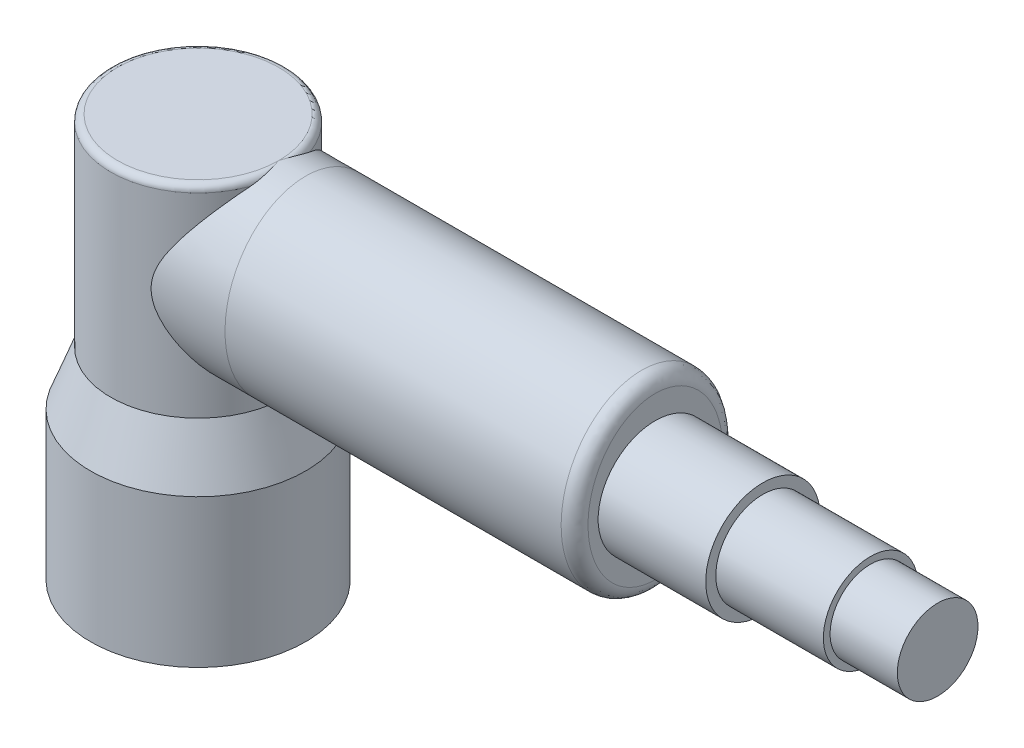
ISO-10303-21;
HEADER;
FILE_DESCRIPTION(('STEP AP214'),'2;1');
FILE_NAME('part.step','',(''),(''),'','','');
FILE_SCHEMA(('AUTOMOTIVE_DESIGN { 1 0 10303 214 1 1 1 1 }'));
ENDSEC;
DATA;
#1=APPLICATION_CONTEXT('core data for automotive mechanical design processes');
#2=APPLICATION_PROTOCOL_DEFINITION('international standard','automotive_design',2000,#1);
#3=PRODUCT_CONTEXT('',#1,'mechanical');
#4=PRODUCT('Part','Part','',(#3));
#5=PRODUCT_RELATED_PRODUCT_CATEGORY('part','',(#4));
#6=PRODUCT_DEFINITION_FORMATION('','',#4);
#7=PRODUCT_DEFINITION_CONTEXT('part definition',#1,'design');
#8=PRODUCT_DEFINITION('design','',#6,#7);
#9=PRODUCT_DEFINITION_SHAPE('','',#8);
#10=(LENGTH_UNIT() NAMED_UNIT(*) SI_UNIT(.MILLI.,.METRE.));
#11=(NAMED_UNIT(*) PLANE_ANGLE_UNIT() SI_UNIT($,.RADIAN.));
#12=(NAMED_UNIT(*) SI_UNIT($,.STERADIAN.) SOLID_ANGLE_UNIT());
#13=UNCERTAINTY_MEASURE_WITH_UNIT(LENGTH_MEASURE(1.E-05),#10,'distance_accuracy_value','');
#14=(GEOMETRIC_REPRESENTATION_CONTEXT(3) GLOBAL_UNCERTAINTY_ASSIGNED_CONTEXT((#13)) GLOBAL_UNIT_ASSIGNED_CONTEXT((#10,
#11,#12)) REPRESENTATION_CONTEXT('',''));
#15=CARTESIAN_POINT('',(0.,0.,0.));
#16=DIRECTION('',(0.,0.,1.));
#17=DIRECTION('',(1.,0.,0.));
#18=AXIS2_PLACEMENT_3D('',#15,#16,#17);
#19=CARTESIAN_POINT('',(34.,23.,0.));
#20=DIRECTION('',(1.,0.,0.));
#21=DIRECTION('',(0.,1.,0.));
#22=AXIS2_PLACEMENT_3D('',#19,#20,#21);
#23=ELLIPSE('',#22,7.,6.);
#24=DIRECTION('',(-1.,0.,0.));
#25=VECTOR('',#24,1.);
#26=SURFACE_OF_LINEAR_EXTRUSION('',#23,#25);
#27=CARTESIAN_POINT('',(34.,28.939897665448,0.70396525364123));
#28=CARTESIAN_POINT('',(34.,29.9254928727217,0.873086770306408));
#29=CARTESIAN_POINT('',(33.,29.9254928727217,0.873086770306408));
#30=CARTESIAN_POINT('',(34.,28.9610892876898,0.580471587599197));
#31=CARTESIAN_POINT('',(34.,29.9517277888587,0.720203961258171));
#32=CARTESIAN_POINT('',(33.,29.9517277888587,0.720203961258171));
#33=CARTESIAN_POINT('',(34.,28.9767472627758,0.456036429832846));
#34=CARTESIAN_POINT('',(34.,29.9711472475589,0.565935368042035));
#35=CARTESIAN_POINT('',(33.,29.9711472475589,0.565935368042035));
#36=CARTESIAN_POINT('',(34.,28.9967585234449,0.206214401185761));
#37=CARTESIAN_POINT('',(34.,29.9959734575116,0.256001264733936));
#38=CARTESIAN_POINT('',(33.,29.9959734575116,0.256001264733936));
#39=CARTESIAN_POINT('',(34.,29.0011082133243,0.0808272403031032));
#40=CARTESIAN_POINT('',(34.,30.0013757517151,0.100335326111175));
#41=CARTESIAN_POINT('',(33.,30.0013757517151,0.100335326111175));
#42=CARTESIAN_POINT('',(34.,28.9984147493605,-0.169737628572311));
#43=CARTESIAN_POINT('',(34.,29.9980320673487,-0.210706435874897));
#44=CARTESIAN_POINT('',(33.,29.9980320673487,-0.210706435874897));
#45=CARTESIAN_POINT('',(34.,28.9913800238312,-0.294915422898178));
#46=CARTESIAN_POINT('',(34.,29.9892965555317,-0.366082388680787));
#47=CARTESIAN_POINT('',(33.,29.9892965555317,-0.366082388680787));
#48=CARTESIAN_POINT('',(34.,28.9660628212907,-0.544142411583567));
#49=CARTESIAN_POINT('',(34.,29.9578998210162,-0.675165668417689));
#50=CARTESIAN_POINT('',(33.,29.9578998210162,-0.675165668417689));
#51=CARTESIAN_POINT('',(34.,28.9477761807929,-0.668191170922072));
#52=CARTESIAN_POINT('',(34.,29.9352334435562,-0.828872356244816));
#53=CARTESIAN_POINT('',(33.,29.9352334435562,-0.828872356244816));
#54=CARTESIAN_POINT('',(34.,28.879592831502,-1.02065753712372));
#55=CARTESIAN_POINT('',(34.,29.8508805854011,-1.26490222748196));
#56=CARTESIAN_POINT('',(33.,29.8508805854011,-1.26490222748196));
#57=CARTESIAN_POINT('',(34.,28.8160359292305,-1.24657006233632));
#58=CARTESIAN_POINT('',(34.,29.7724012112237,-1.54351165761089));
#59=CARTESIAN_POINT('',(33.,29.7724012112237,-1.54351165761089));
#60=CARTESIAN_POINT('',(34.,28.6538803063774,-1.68522716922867));
#61=CARTESIAN_POINT('',(34.,29.5733930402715,-2.08188608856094));
#62=CARTESIAN_POINT('',(33.,29.5733930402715,-2.08188608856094));
#63=CARTESIAN_POINT('',(34.,28.5552769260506,-1.89796999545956));
#64=CARTESIAN_POINT('',(34.,29.4528586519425,-2.34164857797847));
#65=CARTESIAN_POINT('',(33.,29.4528586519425,-2.34164857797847));
#66=CARTESIAN_POINT('',(34.,28.3210098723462,-2.31765716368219));
#67=CARTESIAN_POINT('',(34.,29.1684347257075,-2.85119918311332));
#68=CARTESIAN_POINT('',(33.,29.1684347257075,-2.85119918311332));
#69=CARTESIAN_POINT('',(34.,28.1835848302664,-2.52361506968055));
#70=CARTESIAN_POINT('',(34.,29.0025007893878,-3.09962129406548));
#71=CARTESIAN_POINT('',(33.,29.0025007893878,-3.09962129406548));
#72=CARTESIAN_POINT('',(34.,27.8800496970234,-2.91308114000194));
#73=CARTESIAN_POINT('',(34.,28.6385714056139,-3.56658311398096));
#74=CARTESIAN_POINT('',(33.,28.6385714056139,-3.56658311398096));
#75=CARTESIAN_POINT('',(34.,27.7139272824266,-3.09657960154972));
#76=CARTESIAN_POINT('',(34.,28.4405621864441,-3.78510991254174));
#77=CARTESIAN_POINT('',(33.,28.4405621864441,-3.78510991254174));
#78=CARTESIAN_POINT('',(34.,27.3338207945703,-3.46279799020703));
#79=CARTESIAN_POINT('',(34.,27.9903456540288,-4.21888144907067));
#80=CARTESIAN_POINT('',(33.,27.9903456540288,-4.21888144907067));
#81=CARTESIAN_POINT('',(34.,27.1163964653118,-3.64194089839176));
#82=CARTESIAN_POINT('',(34.,27.734429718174,-4.42954251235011));
#83=CARTESIAN_POINT('',(33.,27.734429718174,-4.42954251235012));
#84=CARTESIAN_POINT('',(34.,26.6582727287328,-3.96736509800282));
#85=CARTESIAN_POINT('',(34.,27.1983868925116,-4.81031387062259));
#86=CARTESIAN_POINT('',(33.,27.1983868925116,-4.81031387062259));
#87=CARTESIAN_POINT('',(34.,26.4175601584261,-4.11362764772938));
#88=CARTESIAN_POINT('',(34.,26.9182463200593,-4.98040104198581));
#89=CARTESIAN_POINT('',(33.,26.9182463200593,-4.98040104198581));
#90=CARTESIAN_POINT('',(34.,25.8771120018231,-4.39450161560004));
#91=CARTESIAN_POINT('',(34.,26.2921329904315,-5.30579922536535));
#92=CARTESIAN_POINT('',(33.,26.2921329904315,-5.30579922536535));
#93=CARTESIAN_POINT('',(34.,25.5742368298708,-4.52307680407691));
#94=CARTESIAN_POINT('',(34.,25.9429843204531,-5.45388559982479));
#95=CARTESIAN_POINT('',(33.,25.9429843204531,-5.45388559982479));
#96=CARTESIAN_POINT('',(34.,24.9530376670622,-4.73480028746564));
#97=CARTESIAN_POINT('',(34.,25.2294374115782,-5.69708024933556));
#98=CARTESIAN_POINT('',(33.,25.2294374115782,-5.69708024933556));
#99=CARTESIAN_POINT('',(34.,24.6347052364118,-4.81792345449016));
#100=CARTESIAN_POINT('',(34.,24.8650308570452,-5.79215922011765));
#101=CARTESIAN_POINT('',(33.,24.8650308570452,-5.79215922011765));
#102=CARTESIAN_POINT('',(34.,23.9430138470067,-4.94765903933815));
#103=CARTESIAN_POINT('',(34.,24.0747881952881,-5.94038274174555));
#104=CARTESIAN_POINT('',(33.,24.0747881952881,-5.94038274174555));
#105=CARTESIAN_POINT('',(34.,23.5683330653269,-4.98728852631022));
#106=CARTESIAN_POINT('',(34.,23.6476638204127,-5.98551518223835));
#107=CARTESIAN_POINT('',(33.,23.6476638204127,-5.98551518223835));
#108=CARTESIAN_POINT('',(34.,22.8171937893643,-5.00752535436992));
#109=CARTESIAN_POINT('',(34.,22.7916654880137,-6.00857489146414));
#110=CARTESIAN_POINT('',(33.,22.7916654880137,-6.00857489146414));
#111=CARTESIAN_POINT('',(34.,22.4407341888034,-4.98808919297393));
#112=CARTESIAN_POINT('',(34.,22.3627904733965,-5.98645262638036));
#113=CARTESIAN_POINT('',(33.,22.3627904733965,-5.98645262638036));
#114=CARTESIAN_POINT('',(34.,21.670075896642,-4.88665993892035));
#115=CARTESIAN_POINT('',(34.,21.4834642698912,-5.87072532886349));
#116=CARTESIAN_POINT('',(33.,21.4834642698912,-5.87072532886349));
#117=CARTESIAN_POINT('',(34.,21.2764142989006,-4.80049819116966));
#118=CARTESIAN_POINT('',(34.,21.0335318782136,-5.77235643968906));
#119=CARTESIAN_POINT('',(33.,21.0335318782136,-5.77235643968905));
#120=CARTESIAN_POINT('',(34.,20.5103709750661,-4.5601331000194));
#121=CARTESIAN_POINT('',(34.,20.15458723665,-5.49657221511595));
#122=CARTESIAN_POINT('',(33.,20.15458723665,-5.49657221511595));
#123=CARTESIAN_POINT('',(34.,20.1379734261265,-4.40598111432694));
#124=CARTESIAN_POINT('',(34.,19.7255594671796,-5.31921654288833));
#125=CARTESIAN_POINT('',(33.,19.7255594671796,-5.31921654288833));
#126=CARTESIAN_POINT('',(34.,19.502327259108,-4.06862670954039));
#127=CARTESIAN_POINT('',(34.,18.9887427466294,-4.9281583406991));
#128=CARTESIAN_POINT('',(33.,18.9887427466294,-4.9281583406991));
#129=CARTESIAN_POINT('',(34.,19.2324040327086,-3.89796490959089));
#130=CARTESIAN_POINT('',(34.,18.6741936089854,-4.72948683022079));
#131=CARTESIAN_POINT('',(33.,18.6741936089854,-4.72948683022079));
#132=CARTESIAN_POINT('',(34.,18.7242163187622,-3.51466919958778));
#133=CARTESIAN_POINT('',(34.,18.0782305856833,-4.27999154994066));
#134=CARTESIAN_POINT('',(33.,18.0782305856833,-4.27999154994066));
#135=CARTESIAN_POINT('',(34.,18.4859133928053,-3.30208704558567));
#136=CARTESIAN_POINT('',(34.,17.7967765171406,-4.02923206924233));
#137=CARTESIAN_POINT('',(33.,17.7967765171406,-4.02923206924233));
#138=CARTESIAN_POINT('',(34.,18.0849279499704,-2.87334966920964));
#139=CARTESIAN_POINT('',(34.,17.3197134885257,-3.51913991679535));
#140=CARTESIAN_POINT('',(33.,17.3197134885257,-3.51913991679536));
#141=CARTESIAN_POINT('',(34.,17.9162507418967,-2.6628102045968));
#142=CARTESIAN_POINT('',(34.,17.1175596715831,-3.26710423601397));
#143=CARTESIAN_POINT('',(33.,17.1175596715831,-3.26710423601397));
#144=CARTESIAN_POINT('',(34.,17.6159793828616,-2.21659068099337));
#145=CARTESIAN_POINT('',(34.,16.7554234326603,-2.72894311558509));
#146=CARTESIAN_POINT('',(33.,16.7554234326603,-2.72894311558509));
#147=CARTESIAN_POINT('',(34.,17.4843734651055,-1.9809186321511));
#148=CARTESIAN_POINT('',(34.,16.5954276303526,-2.44282853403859));
#149=CARTESIAN_POINT('',(33.,16.5954276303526,-2.44282853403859));
#150=CARTESIAN_POINT('',(34.,17.2770616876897,-1.51607807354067));
#151=CARTESIAN_POINT('',(34.,16.3420801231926,-1.87473734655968));
#152=CARTESIAN_POINT('',(33.,16.3420801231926,-1.87473734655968));
#153=CARTESIAN_POINT('',(34.,17.1968680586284,-1.28893293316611));
#154=CARTESIAN_POINT('',(34.,16.2434138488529,-1.59562103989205));
#155=CARTESIAN_POINT('',(33.,16.2434138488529,-1.59562103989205));
#156=CARTESIAN_POINT('',(34.,17.1060764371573,-0.940997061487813));
#157=CARTESIAN_POINT('',(34.,16.1313880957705,-1.16632594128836));
#158=CARTESIAN_POINT('',(33.,16.1313880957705,-1.16632594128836));
#159=CARTESIAN_POINT('',(34.,17.0807365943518,-0.82390123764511));
#160=CARTESIAN_POINT('',(34.,16.1000513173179,-1.02156417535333));
#161=CARTESIAN_POINT('',(33.,16.1000513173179,-1.02156417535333));
#162=CARTESIAN_POINT('',(34.,17.0401491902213,-0.587992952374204));
#163=CARTESIAN_POINT('',(34.,16.0498061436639,-0.729516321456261));
#164=CARTESIAN_POINT('',(33.,16.0498061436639,-0.729516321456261));
#165=CARTESIAN_POINT('',(34.,17.0248960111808,-0.469181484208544));
#166=CARTESIAN_POINT('',(34.,16.0308908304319,-0.582231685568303));
#167=CARTESIAN_POINT('',(33.,16.0308908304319,-0.582231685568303));
#168=CARTESIAN_POINT('',(34.,17.0098710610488,-0.291775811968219));
#169=CARTESIAN_POINT('',(34.,16.0122514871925,-0.362154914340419));
#170=CARTESIAN_POINT('',(33.,16.0122514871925,-0.362154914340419));
#171=CARTESIAN_POINT('',(34.,17.0061713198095,-0.233487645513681));
#172=CARTESIAN_POINT('',(34.,16.0076600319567,-0.289821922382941));
#173=CARTESIAN_POINT('',(33.,16.0076600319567,-0.289821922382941));
#174=CARTESIAN_POINT('',(34.,17.0012353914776,-0.116802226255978));
#175=CARTESIAN_POINT('',(34.,16.0015337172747,-0.144995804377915));
#176=CARTESIAN_POINT('',(33.,16.0015337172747,-0.144995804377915));
#177=CARTESIAN_POINT('',(34.,16.9999993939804,-0.0584049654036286));
#178=CARTESIAN_POINT('',(34.,15.9999990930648,-0.0725026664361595));
#179=CARTESIAN_POINT('',(33.,15.9999990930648,-0.0725026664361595));
#180=CARTESIAN_POINT('',(34.,17.0000012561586,0.121061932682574));
#181=CARTESIAN_POINT('',(34.,16.0000018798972,0.150283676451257));
#182=CARTESIAN_POINT('',(33.,16.0000018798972,0.150283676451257));
#183=CARTESIAN_POINT('',(34.,17.0053155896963,0.242156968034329));
#184=CARTESIAN_POINT('',(34.,16.006601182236,0.300608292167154));
#185=CARTESIAN_POINT('',(33.,16.006601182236,0.300608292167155));
#186=CARTESIAN_POINT('',(34.,17.0264990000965,0.483469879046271));
#187=CARTESIAN_POINT('',(34.,16.0328782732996,0.599949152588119));
#188=CARTESIAN_POINT('',(33.,16.0328782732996,0.599949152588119));
#189=CARTESIAN_POINT('',(34.,17.042374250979,0.603687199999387));
#190=CARTESIAN_POINT('',(34.,16.0525637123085,0.748964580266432));
#191=CARTESIAN_POINT('',(33.,16.0525637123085,0.748964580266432));
#192=CARTESIAN_POINT('',(34.,17.0844912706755,0.842529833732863));
#193=CARTESIAN_POINT('',(34.,16.1046959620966,1.04460358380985));
#194=CARTESIAN_POINT('',(33.,16.1046959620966,1.04460358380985));
#195=CARTESIAN_POINT('',(34.,17.1107522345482,0.961151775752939));
#196=CARTESIAN_POINT('',(34.,16.1371664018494,1.19122220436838));
#197=CARTESIAN_POINT('',(33.,16.1371664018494,1.19122220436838));
#198=CARTESIAN_POINT('',(34.,17.1732538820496,1.19575235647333));
#199=CARTESIAN_POINT('',(34.,16.2142659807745,1.48061761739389));
#200=CARTESIAN_POINT('',(33.,16.2142659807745,1.48061761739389));
#201=CARTESIAN_POINT('',(34.,17.2094986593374,1.31172988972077));
#202=CARTESIAN_POINT('',(34.,16.2589001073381,1.62339280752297));
#203=CARTESIAN_POINT('',(33.,16.2589001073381,1.62339280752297));
#204=CARTESIAN_POINT('',(34.,17.3321298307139,1.65343267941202));
#205=CARTESIAN_POINT('',(34.,16.4094926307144,2.04300371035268));
#206=CARTESIAN_POINT('',(33.,16.4094926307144,2.04300371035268));
#207=CARTESIAN_POINT('',(34.,17.432650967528,1.87423872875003));
#208=CARTESIAN_POINT('',(34.,16.5324387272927,2.31274951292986));
#209=CARTESIAN_POINT('',(33.,16.5324387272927,2.31274951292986));
#210=CARTESIAN_POINT('',(34.,17.6665424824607,2.29730679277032));
#211=CARTESIAN_POINT('',(34.,16.8164947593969,2.82657183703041));
#212=CARTESIAN_POINT('',(33.,16.8164947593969,2.82657183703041));
#213=CARTESIAN_POINT('',(34.,17.7999053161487,2.49957305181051));
#214=CARTESIAN_POINT('',(34.,16.9775959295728,3.07065423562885));
#215=CARTESIAN_POINT('',(33.,16.9775959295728,3.07065423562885));
#216=CARTESIAN_POINT('',(34.,18.1061850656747,2.89811322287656));
#217=CARTESIAN_POINT('',(34.,17.3450266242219,3.54877046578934));
#218=CARTESIAN_POINT('',(33.,17.3450266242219,3.54877046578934));
#219=CARTESIAN_POINT('',(34.,18.2814174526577,3.0926033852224));
#220=CARTESIAN_POINT('',(34.,17.5539483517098,3.78042566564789));
#221=CARTESIAN_POINT('',(33.,17.5539483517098,3.78042566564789));
#222=CARTESIAN_POINT('',(34.,18.6579618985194,3.45435564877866));
#223=CARTESIAN_POINT('',(34.,17.9998961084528,4.20885547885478));
#224=CARTESIAN_POINT('',(33.,17.9998961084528,4.20885547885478));
#225=CARTESIAN_POINT('',(34.,18.8592881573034,3.62160281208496));
#226=CARTESIAN_POINT('',(34.,18.2369374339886,4.40561096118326));
#227=CARTESIAN_POINT('',(33.,18.2369374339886,4.40561096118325));
#228=CARTESIAN_POINT('',(34.,19.3162431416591,3.95222703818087));
#229=CARTESIAN_POINT('',(34.,18.7719706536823,4.79273165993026));
#230=CARTESIAN_POINT('',(33.,18.7719706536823,4.79273165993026));
#231=CARTESIAN_POINT('',(34.,19.5754081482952,4.11071381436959));
#232=CARTESIAN_POINT('',(34.,19.0736490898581,4.97705013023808));
#233=CARTESIAN_POINT('',(33.,19.0736490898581,4.97705013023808));
#234=CARTESIAN_POINT('',(34.,20.1137108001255,4.38895521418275));
#235=CARTESIAN_POINT('',(34.,19.6971913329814,5.29934750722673));
#236=CARTESIAN_POINT('',(33.,19.6971913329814,5.29934750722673));
#237=CARTESIAN_POINT('',(34.,20.3928602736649,4.50868666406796));
#238=CARTESIAN_POINT('',(34.,20.0190670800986,5.43729869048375));
#239=CARTESIAN_POINT('',(33.,20.0190670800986,5.43729869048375));
#240=CARTESIAN_POINT('',(34.,21.0113005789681,4.72571280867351));
#241=CARTESIAN_POINT('',(34.,20.7297488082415,5.68669797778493));
#242=CARTESIAN_POINT('',(33.,20.7297488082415,5.68669797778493));
#243=CARTESIAN_POINT('',(34.,21.3529900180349,4.81619371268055));
#244=CARTESIAN_POINT('',(34.,21.120927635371,5.79018939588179));
#245=CARTESIAN_POINT('',(33.,21.120927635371,5.79018939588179));
#246=CARTESIAN_POINT('',(34.,22.0460683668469,4.94501313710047));
#247=CARTESIAN_POINT('',(34.,21.9127214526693,5.93735314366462));
#248=CARTESIAN_POINT('',(33.,21.9127214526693,5.93735314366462));
#249=CARTESIAN_POINT('',(34.,22.3974622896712,4.98332417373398));
#250=CARTESIAN_POINT('',(34.,22.3133413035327,5.98099394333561));
#251=CARTESIAN_POINT('',(33.,22.3133413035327,5.98099394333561));
#252=CARTESIAN_POINT('',(34.,23.1420179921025,5.0093301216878));
#253=CARTESIAN_POINT('',(34.,23.1618671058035,6.01063526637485));
#254=CARTESIAN_POINT('',(33.,23.1618671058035,6.01063526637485));
#255=CARTESIAN_POINT('',(34.,23.535411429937,4.99081439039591));
#256=CARTESIAN_POINT('',(34.,23.609999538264,5.98956310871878));
#257=CARTESIAN_POINT('',(33.,23.609999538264,5.98956310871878));
#258=CARTESIAN_POINT('',(34.,24.3140996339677,4.88914963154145));
#259=CARTESIAN_POINT('',(34.,24.4984720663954,5.87356491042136));
#260=CARTESIAN_POINT('',(33.,24.4984720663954,5.87356491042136));
#261=CARTESIAN_POINT('',(34.,24.6993883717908,4.80595412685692));
#262=CARTESIAN_POINT('',(34.,24.9388063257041,5.77858576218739));
#263=CARTESIAN_POINT('',(33.,24.9388063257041,5.77858576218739));
#264=CARTESIAN_POINT('',(34.,25.4556795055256,4.57277708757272));
#265=CARTESIAN_POINT('',(34.,25.8063653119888,5.51110816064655));
#266=CARTESIAN_POINT('',(33.,25.8063653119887,5.51110816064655));
#267=CARTESIAN_POINT('',(34.,25.8263862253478,4.42182573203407));
#268=CARTESIAN_POINT('',(34.,26.2332997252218,5.33748367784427));
#269=CARTESIAN_POINT('',(33.,26.2332997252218,5.33748367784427));
#270=CARTESIAN_POINT('',(34.,26.5326793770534,4.05280835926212));
#271=CARTESIAN_POINT('',(34.,27.0516816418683,4.90991097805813));
#272=CARTESIAN_POINT('',(33.,27.0516816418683,4.90991097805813));
#273=CARTESIAN_POINT('',(34.,26.8683277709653,3.83486353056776));
#274=CARTESIAN_POINT('',(34.,27.4431915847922,4.65610777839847));
#275=CARTESIAN_POINT('',(33.,27.4431915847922,4.65610777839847));
#276=CARTESIAN_POINT('',(34.,27.4003688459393,3.4041340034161));
#277=CARTESIAN_POINT('',(34.,28.0688353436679,4.14957990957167));
#278=CARTESIAN_POINT('',(33.,28.0688353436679,4.14957990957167));
#279=CARTESIAN_POINT('',(34.,27.6094618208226,3.20693474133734));
#280=CARTESIAN_POINT('',(34.,28.3163699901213,3.91638311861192));
#281=CARTESIAN_POINT('',(33.,28.3163699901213,3.91638311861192));
#282=CARTESIAN_POINT('',(34.,27.9926430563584,2.7806177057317));
#283=CARTESIAN_POINT('',(34.,28.7730405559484,3.40830128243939));
#284=CARTESIAN_POINT('',(33.,28.7730405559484,3.40830128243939));
#285=CARTESIAN_POINT('',(34.,28.1667503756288,2.55151742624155));
#286=CARTESIAN_POINT('',(34.,28.9821973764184,3.13343907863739));
#287=CARTESIAN_POINT('',(33.,28.9821973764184,3.13343907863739));
#288=CARTESIAN_POINT('',(34.,28.3956017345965,2.18653070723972));
#289=CARTESIAN_POINT('',(34.,29.2589201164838,2.69209522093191));
#290=CARTESIAN_POINT('',(33.,29.2589201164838,2.69209522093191));
#291=CARTESIAN_POINT('',(34.,28.4667418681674,2.06070943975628));
#292=CARTESIAN_POINT('',(34.,29.3452901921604,2.53939998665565));
#293=CARTESIAN_POINT('',(33.,29.3452901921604,2.53939998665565));
#294=CARTESIAN_POINT('',(34.,28.5968371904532,1.80294168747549));
#295=CARTESIAN_POINT('',(34.,29.5037412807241,2.2254501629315));
#296=CARTESIAN_POINT('',(33.,29.5037412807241,2.2254501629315));
#297=CARTESIAN_POINT('',(34.,28.6557987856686,1.67099846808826));
#298=CARTESIAN_POINT('',(34.,29.5758298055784,2.06420013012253));
#299=CARTESIAN_POINT('',(33.,29.5758298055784,2.06420013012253));
#300=CARTESIAN_POINT('',(34.,28.7605156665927,1.40203505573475));
#301=CARTESIAN_POINT('',(34.,29.7042131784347,1.73444758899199));
#302=CARTESIAN_POINT('',(33.,29.7042131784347,1.73444758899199));
#303=CARTESIAN_POINT('',(34.,28.806276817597,1.2650171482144));
#304=CARTESIAN_POINT('',(34.,29.7605150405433,1.56594834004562));
#305=CARTESIAN_POINT('',(33.,29.7605150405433,1.56594834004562));
#306=CARTESIAN_POINT('',(34.,28.8837678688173,0.987070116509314));
#307=CARTESIAN_POINT('',(34.,29.8560515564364,1.22327329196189));
#308=CARTESIAN_POINT('',(33.,29.8560515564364,1.22327329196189));
#309=CARTESIAN_POINT('',(34.,28.915500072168,0.84614163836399));
#310=CARTESIAN_POINT('',(34.,29.8952890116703,1.04909842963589));
#311=CARTESIAN_POINT('',(33.,29.8952890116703,1.04909842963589));
#312=CARTESIAN_POINT('',(34.,28.939897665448,0.70396525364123));
#313=CARTESIAN_POINT('',(34.,29.9254928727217,0.873086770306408));
#314=CARTESIAN_POINT('',(33.,29.9254928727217,0.873086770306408));
#315=(BOUNDED_SURFACE() B_SPLINE_SURFACE(3,2,((#27,#28,#29),(#30,#31,#32),(#33,#34,#35),(#36,
#37,#38),(#39,#40,#41),(#42,#43,#44),(#45,#46,#47),(#48,#49,#50),(#51,#52,#53),(#54,#55,#56),
(#57,#58,#59),(#60,#61,#62),(#63,#64,#65),(#66,#67,#68),(#69,#70,#71),(#72,#73,#74),(#75,#76,
#77),(#78,#79,#80),(#81,#82,#83),(#84,#85,#86),(#87,#88,#89),(#90,#91,#92),(#93,#94,#95),(#96,
#97,#98),(#99,#100,#101),(#102,#103,#104),(#105,#106,#107),(#108,#109,#110),(#111,#112,#113),
(#114,#115,#116),(#117,#118,#119),(#120,#121,#122),(#123,#124,#125),(#126,#127,#128),(#129,#130,
#131),(#132,#133,#134),(#135,#136,#137),(#138,#139,#140),(#141,#142,#143),(#144,#145,#146),
(#147,#148,#149),(#150,#151,#152),(#153,#154,#155),(#156,#157,#158),(#159,#160,#161),(#162,#163,
#164),(#165,#166,#167),(#168,#169,#170),(#171,#172,#173),(#174,#175,#176),(#177,#178,#179),
(#180,#181,#182),(#183,#184,#185),(#186,#187,#188),(#189,#190,#191),(#192,#193,#194),(#195,#196,
#197),(#198,#199,#200),(#201,#202,#203),(#204,#205,#206),(#207,#208,#209),(#210,#211,#212),
(#213,#214,#215),(#216,#217,#218),(#219,#220,#221),(#222,#223,#224),(#225,#226,#227),(#228,#229,
#230),(#231,#232,#233),(#234,#235,#236),(#237,#238,#239),(#240,#241,#242),(#243,#244,#245),
(#246,#247,#248),(#249,#250,#251),(#252,#253,#254),(#255,#256,#257),(#258,#259,#260),(#261,#262,
#263),(#264,#265,#266),(#267,#268,#269),(#270,#271,#272),(#273,#274,#275),(#276,#277,#278),
(#279,#280,#281),(#282,#283,#284),(#285,#286,#287),(#288,#289,#290),(#291,#292,#293),(#294,#295,
#296),(#297,#298,#299),(#300,#301,#302),(#303,#304,#305),(#306,#307,#308),(#309,#310,#311),
(#312,#313,#314)),.UNSPECIFIED.,.T.,.F.,.F.) B_SPLINE_SURFACE_WITH_KNOTS((4,2,2,2,2,2,2,2,2,2,2,
2,2,2,2,2,2,2,2,2,2,2,2,2,2,2,2,2,2,2,2,2,2,2,2,2,2,2,2,2,2,2,2,2,2,2,2,4),(3,3),(0.,
0.375752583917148,0.751624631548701,1.12721853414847,1.50295149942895,2.20358352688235,
2.90430874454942,3.64414571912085,4.3843011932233,5.2262381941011,6.06865388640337,
7.05191130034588,8.03571175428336,9.16120780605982,10.2875329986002,11.4905358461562,
12.6926315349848,13.6469054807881,14.6000085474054,15.4060040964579,16.2117435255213,
16.9308839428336,17.2899438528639,17.648803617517,17.8239764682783,17.9991627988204,
18.3622893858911,18.7256284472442,19.0896422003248,19.4538054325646,20.1781858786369,
20.9024000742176,21.6847372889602,22.4675020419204,23.3753664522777,24.2837727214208,
25.3398861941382,26.3965558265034,27.5726616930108,28.749613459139,29.9439769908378,
31.1361925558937,31.9951655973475,32.8536694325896,33.2867597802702,33.7196217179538,
34.152291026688,34.5848892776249),(0.,1.),
.UNSPECIFIED.) GEOMETRIC_REPRESENTATION_ITEM() RATIONAL_B_SPLINE_SURFACE(((1.,0.707106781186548,
1.),(1.,0.707106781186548,1.),(1.,0.707106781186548,1.),(1.,0.707106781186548,1.),(1.,
0.707106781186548,1.),(1.,0.707106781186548,1.),(1.,0.707106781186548,1.),(1.,0.707106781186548,
1.),(1.,0.707106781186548,1.),(1.,0.707106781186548,1.),(1.,0.707106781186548,1.),(1.,
0.707106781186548,1.),(1.,0.707106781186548,1.),(1.,0.707106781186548,1.),(1.,0.707106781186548,
1.),(1.,0.707106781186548,1.),(1.,0.707106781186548,1.),(1.,0.707106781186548,1.),(1.,
0.707106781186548,1.),(1.,0.707106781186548,1.),(1.,0.707106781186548,1.),(1.,0.707106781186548,
1.),(1.,0.707106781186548,1.),(1.,0.707106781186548,1.),(1.,0.707106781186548,1.),(1.,
0.707106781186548,1.),(1.,0.707106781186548,1.),(1.,0.707106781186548,1.),(1.,0.707106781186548,
1.),(1.,0.707106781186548,1.),(1.,0.707106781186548,1.),(1.,0.707106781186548,1.),(1.,
0.707106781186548,1.),(1.,0.707106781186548,1.),(1.,0.707106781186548,1.),(1.,0.707106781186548,
1.),(1.,0.707106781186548,1.),(1.,0.707106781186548,1.),(1.,0.707106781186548,1.),(1.,
0.707106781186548,1.),(1.,0.707106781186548,1.),(1.,0.707106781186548,1.),(1.,0.707106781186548,
1.),(1.,0.707106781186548,1.),(1.,0.707106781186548,1.),(1.,0.707106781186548,1.),(1.,
0.707106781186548,1.),(1.,0.707106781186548,1.),(1.,0.707106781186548,1.),(1.,0.707106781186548,
1.),(1.,0.707106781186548,1.),(1.,0.707106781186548,1.),(1.,0.707106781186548,1.),(1.,
0.707106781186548,1.),(1.,0.707106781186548,1.),(1.,0.707106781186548,1.),(1.,0.707106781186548,
1.),(1.,0.707106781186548,1.),(1.,0.707106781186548,1.),(1.,0.707106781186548,1.),(1.,
0.707106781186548,1.),(1.,0.707106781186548,1.),(1.,0.707106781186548,1.),(1.,0.707106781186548,
1.),(1.,0.707106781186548,1.),(1.,0.707106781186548,1.),(1.,0.707106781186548,1.),(1.,
0.707106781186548,1.),(1.,0.707106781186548,1.),(1.,0.707106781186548,1.),(1.,0.707106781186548,
1.),(1.,0.707106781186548,1.),(1.,0.707106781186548,1.),(1.,0.707106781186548,1.),(1.,
0.707106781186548,1.),(1.,0.707106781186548,1.),(1.,0.707106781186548,1.),(1.,0.707106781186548,
1.),(1.,0.707106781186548,1.),(1.,0.707106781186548,1.),(1.,0.707106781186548,1.),(1.,
0.707106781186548,1.),(1.,0.707106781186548,1.),(1.,0.707106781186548,1.),(1.,0.707106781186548,
1.),(1.,0.707106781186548,1.),(1.,0.707106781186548,1.),(1.,0.707106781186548,1.),(1.,
0.707106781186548,1.),(1.,0.707106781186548,1.),(1.,0.707106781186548,1.),(1.,0.707106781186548,
1.),(1.,0.707106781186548,1.),(1.,0.707106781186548,1.),(1.,0.707106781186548,1.),(1.,
0.707106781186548,1.))) REPRESENTATION_ITEM('') SURFACE());
#316=CARTESIAN_POINT('',(33.,29.9254928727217,0.873086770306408));
#317=CARTESIAN_POINT('',(33.,29.9517277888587,0.72020396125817));
#318=CARTESIAN_POINT('',(33.,29.9711472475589,0.565935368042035));
#319=CARTESIAN_POINT('',(33.,29.9959734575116,0.256001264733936));
#320=CARTESIAN_POINT('',(33.,30.0013757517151,0.100335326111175));
#321=CARTESIAN_POINT('',(33.,29.9980320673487,-0.210706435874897));
#322=CARTESIAN_POINT('',(33.,29.9892965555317,-0.366082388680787));
#323=CARTESIAN_POINT('',(33.,29.9578998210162,-0.675165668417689));
#324=CARTESIAN_POINT('',(33.,29.9352334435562,-0.828872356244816));
#325=CARTESIAN_POINT('',(33.,29.8508805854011,-1.26490222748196));
#326=CARTESIAN_POINT('',(33.,29.7724012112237,-1.54351165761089));
#327=CARTESIAN_POINT('',(33.,29.5733930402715,-2.08188608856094));
#328=CARTESIAN_POINT('',(33.,29.4528586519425,-2.34164857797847));
#329=CARTESIAN_POINT('',(33.,29.1684347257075,-2.85119918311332));
#330=CARTESIAN_POINT('',(33.,29.0025007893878,-3.09962129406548));
#331=CARTESIAN_POINT('',(33.,28.6385714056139,-3.56658311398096));
#332=CARTESIAN_POINT('',(33.,28.4405621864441,-3.78510991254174));
#333=CARTESIAN_POINT('',(33.,27.9903456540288,-4.21888144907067));
#334=CARTESIAN_POINT('',(33.,27.734429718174,-4.42954251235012));
#335=CARTESIAN_POINT('',(33.,27.1983868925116,-4.81031387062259));
#336=CARTESIAN_POINT('',(33.,26.9182463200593,-4.98040104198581));
#337=CARTESIAN_POINT('',(33.,26.2921329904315,-5.30579922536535));
#338=CARTESIAN_POINT('',(33.,25.9429843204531,-5.45388559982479));
#339=CARTESIAN_POINT('',(33.,25.2294374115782,-5.69708024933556));
#340=CARTESIAN_POINT('',(33.,24.8650308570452,-5.79215922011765));
#341=CARTESIAN_POINT('',(33.,24.0747881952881,-5.94038274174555));
#342=CARTESIAN_POINT('',(33.,23.6476638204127,-5.98551518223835));
#343=CARTESIAN_POINT('',(33.,22.7916654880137,-6.00857489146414));
#344=CARTESIAN_POINT('',(33.,22.3627904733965,-5.98645262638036));
#345=CARTESIAN_POINT('',(33.,21.4834642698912,-5.87072532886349));
#346=CARTESIAN_POINT('',(33.,21.0335318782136,-5.77235643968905));
#347=CARTESIAN_POINT('',(33.,20.15458723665,-5.49657221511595));
#348=CARTESIAN_POINT('',(33.,19.7255594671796,-5.31921654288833));
#349=CARTESIAN_POINT('',(33.,18.9887427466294,-4.9281583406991));
#350=CARTESIAN_POINT('',(33.,18.6741936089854,-4.72948683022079));
#351=CARTESIAN_POINT('',(33.,18.0782305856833,-4.27999154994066));
#352=CARTESIAN_POINT('',(33.,17.7967765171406,-4.02923206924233));
#353=CARTESIAN_POINT('',(33.,17.3197134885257,-3.51913991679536));
#354=CARTESIAN_POINT('',(33.,17.1175596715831,-3.26710423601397));
#355=CARTESIAN_POINT('',(33.,16.7554234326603,-2.72894311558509));
#356=CARTESIAN_POINT('',(33.,16.5954276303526,-2.44282853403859));
#357=CARTESIAN_POINT('',(33.,16.3420801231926,-1.87473734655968));
#358=CARTESIAN_POINT('',(33.,16.2434138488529,-1.59562103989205));
#359=CARTESIAN_POINT('',(33.,16.1313880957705,-1.16632594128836));
#360=CARTESIAN_POINT('',(33.,16.1000513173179,-1.02156417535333));
#361=CARTESIAN_POINT('',(33.,16.0498061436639,-0.729516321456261));
#362=CARTESIAN_POINT('',(33.,16.0308908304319,-0.582231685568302));
#363=CARTESIAN_POINT('',(33.,16.0122514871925,-0.362154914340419));
#364=CARTESIAN_POINT('',(33.,16.0076600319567,-0.289821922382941));
#365=CARTESIAN_POINT('',(33.,16.0015337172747,-0.144995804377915));
#366=CARTESIAN_POINT('',(33.,15.9999990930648,-0.0725026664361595));
#367=CARTESIAN_POINT('',(33.,16.0000018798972,0.150283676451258));
#368=CARTESIAN_POINT('',(33.,16.006601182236,0.300608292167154));
#369=CARTESIAN_POINT('',(33.,16.0328782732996,0.599949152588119));
#370=CARTESIAN_POINT('',(33.,16.0525637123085,0.748964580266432));
#371=CARTESIAN_POINT('',(33.,16.1046959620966,1.04460358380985));
#372=CARTESIAN_POINT('',(33.,16.1371664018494,1.19122220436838));
#373=CARTESIAN_POINT('',(33.,16.2142659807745,1.48061761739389));
#374=CARTESIAN_POINT('',(33.,16.2589001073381,1.62339280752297));
#375=CARTESIAN_POINT('',(33.,16.4094926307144,2.04300371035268));
#376=CARTESIAN_POINT('',(33.,16.5324387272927,2.31274951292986));
#377=CARTESIAN_POINT('',(33.,16.8164947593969,2.82657183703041));
#378=CARTESIAN_POINT('',(33.,16.9775959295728,3.07065423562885));
#379=CARTESIAN_POINT('',(33.,17.3450266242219,3.54877046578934));
#380=CARTESIAN_POINT('',(33.,17.5539483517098,3.78042566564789));
#381=CARTESIAN_POINT('',(33.,17.9998961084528,4.20885547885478));
#382=CARTESIAN_POINT('',(33.,18.2369374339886,4.40561096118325));
#383=CARTESIAN_POINT('',(33.,18.7719706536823,4.79273165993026));
#384=CARTESIAN_POINT('',(33.,19.0736490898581,4.97705013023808));
#385=CARTESIAN_POINT('',(33.,19.6971913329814,5.29934750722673));
#386=CARTESIAN_POINT('',(33.,20.0190670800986,5.43729869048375));
#387=CARTESIAN_POINT('',(33.,20.7297488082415,5.68669797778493));
#388=CARTESIAN_POINT('',(33.,21.120927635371,5.79018939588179));
#389=CARTESIAN_POINT('',(33.,21.9127214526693,5.93735314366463));
#390=CARTESIAN_POINT('',(33.,22.3133413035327,5.98099394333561));
#391=CARTESIAN_POINT('',(33.,23.1618671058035,6.01063526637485));
#392=CARTESIAN_POINT('',(33.,23.609999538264,5.98956310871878));
#393=CARTESIAN_POINT('',(33.,24.4984720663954,5.87356491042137));
#394=CARTESIAN_POINT('',(33.,24.9388063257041,5.77858576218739));
#395=CARTESIAN_POINT('',(33.,25.8063653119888,5.51110816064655));
#396=CARTESIAN_POINT('',(33.,26.2332997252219,5.33748367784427));
#397=CARTESIAN_POINT('',(33.,27.0516816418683,4.90991097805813));
#398=CARTESIAN_POINT('',(33.,27.4431915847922,4.65610777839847));
#399=CARTESIAN_POINT('',(33.,28.0688353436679,4.14957990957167));
#400=CARTESIAN_POINT('',(33.,28.3163699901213,3.91638311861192));
#401=CARTESIAN_POINT('',(33.,28.7730405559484,3.40830128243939));
#402=CARTESIAN_POINT('',(33.,28.9821973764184,3.13343907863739));
#403=CARTESIAN_POINT('',(33.,29.2589201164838,2.69209522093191));
#404=CARTESIAN_POINT('',(33.,29.3452901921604,2.53939998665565));
#405=CARTESIAN_POINT('',(33.,29.5037412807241,2.2254501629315));
#406=CARTESIAN_POINT('',(33.,29.5758298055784,2.06420013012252));
#407=CARTESIAN_POINT('',(33.,29.7042131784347,1.73444758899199));
#408=CARTESIAN_POINT('',(33.,29.7605150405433,1.56594834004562));
#409=CARTESIAN_POINT('',(33.,29.8560515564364,1.22327329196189));
#410=CARTESIAN_POINT('',(33.,29.8952890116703,1.04909842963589));
#411=CARTESIAN_POINT('',(33.,29.9254928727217,0.873086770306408));
#412=B_SPLINE_CURVE_WITH_KNOTS('',3,(#316,#317,#318,#319,#320,#321,#322,#323,#324,#325,#326,
#327,#328,#329,#330,#331,#332,#333,#334,#335,#336,#337,#338,#339,#340,#341,#342,#343,#344,#345,
#346,#347,#348,#349,#350,#351,#352,#353,#354,#355,#356,#357,#358,#359,#360,#361,#362,#363,#364,
#365,#366,#367,#368,#369,#370,#371,#372,#373,#374,#375,#376,#377,#378,#379,#380,#381,#382,#383,
#384,#385,#386,#387,#388,#389,#390,#391,#392,#393,#394,#395,#396,#397,#398,#399,#400,#401,#402,
#403,#404,#405,#406,#407,#408,#409,#410,#411),.UNSPECIFIED.,.T.,.F.,(4,2,2,2,2,2,2,2,2,2,2,2,2,
2,2,2,2,2,2,2,2,2,2,2,2,2,2,2,2,2,2,2,2,2,2,2,2,2,2,2,2,2,2,2,2,2,2,4),(0.,0.375752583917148,
0.751624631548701,1.12721853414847,1.50295149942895,2.20358352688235,2.90430874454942,
3.64414571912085,4.3843011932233,5.2262381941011,6.06865388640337,7.05191130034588,
8.03571175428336,9.16120780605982,10.2875329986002,11.4905358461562,12.6926315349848,
13.6469054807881,14.6000085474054,15.4060040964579,16.2117435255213,16.9308839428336,
17.2899438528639,17.648803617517,17.8239764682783,17.9991627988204,18.3622893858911,
18.7256284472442,19.0896422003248,19.4538054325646,20.1781858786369,20.9024000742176,
21.6847372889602,22.4675020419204,23.3753664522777,24.2837727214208,25.3398861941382,
26.3965558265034,27.5726616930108,28.749613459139,29.9439769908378,31.1361925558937,
31.9951655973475,32.8536694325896,33.2867597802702,33.7196217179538,34.152291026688,
34.5848892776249),.UNSPECIFIED.);
#413=CARTESIAN_POINT('',(33.,29.9254928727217,0.873086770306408));
#414=VERTEX_POINT('',#413);
#415=EDGE_CURVE('E49',#414,#414,#412,.T.);
#416=ORIENTED_EDGE('',*,*,#415,.T.);
#417=EDGE_LOOP('',(#416));
#418=FACE_BOUND('',#417,.T.);
#419=CARTESIAN_POINT('',(8.,23.,0.));
#420=DIRECTION('',(1.,0.,0.));
#421=DIRECTION('',(0.,1.,0.));
#422=AXIS2_PLACEMENT_3D('',#419,#420,#421);
#423=ELLIPSE('',#422,7.,6.);
#424=CARTESIAN_POINT('',(8.,30.,0.));
#425=VERTEX_POINT('',#424);
#426=EDGE_CURVE('E11',#425,#425,#423,.F.);
#427=ORIENTED_EDGE('',*,*,#426,.F.);
#428=EDGE_LOOP('',(#427));
#429=FACE_BOUND('',#428,.T.);
#430=ADVANCED_FACE('F39',(#418,#429),#26,.F.);
#431=CARTESIAN_POINT('',(0.,0.,0.));
#432=DIRECTION('',(0.,-1.,0.));
#433=DIRECTION('',(0.,0.,-1.));
#434=AXIS2_PLACEMENT_3D('',#431,#432,#433);
#435=CYLINDRICAL_SURFACE('',#434,6.5);
#436=CARTESIAN_POINT('',(0.,15.,0.));
#437=DIRECTION('',(0.,-1.,0.));
#438=DIRECTION('',(0.,0.,-1.));
#439=AXIS2_PLACEMENT_3D('',#436,#437,#438);
#440=CIRCLE('',#439,6.5);
#441=CARTESIAN_POINT('',(0.,15.,-6.5));
#442=VERTEX_POINT('',#441);
#443=EDGE_CURVE('E202',#442,#442,#440,.T.);
#444=ORIENTED_EDGE('',*,*,#443,.F.);
#445=EDGE_LOOP('',(#444));
#446=FACE_BOUND('',#445,.T.);
#447=CARTESIAN_POINT('',(0.,29.5,0.));
#448=DIRECTION('',(0.,1.,0.));
#449=DIRECTION('',(0.,0.,1.));
#450=AXIS2_PLACEMENT_3D('',#447,#448,#449);
#451=CIRCLE('',#450,6.5);
#452=CARTESIAN_POINT('',(6.10662069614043,29.5,2.22692246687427));
#453=VERTEX_POINT('',#452);
#454=CARTESIAN_POINT('',(6.10662069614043,29.5,-2.22692246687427));
#455=VERTEX_POINT('',#454);
#456=EDGE_CURVE('E205',#453,#455,#451,.F.);
#457=ORIENTED_EDGE('',*,*,#456,.T.);
#458=CARTESIAN_POINT('',(6.10662069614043,29.5,-2.22692246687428));
#459=CARTESIAN_POINT('',(6.0506394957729,29.4284081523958,-2.38043912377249));
#460=CARTESIAN_POINT('',(5.98987845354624,29.3505190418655,-2.52907155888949));
#461=CARTESIAN_POINT('',(5.86041816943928,29.1839301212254,-2.81606362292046));
#462=CARTESIAN_POINT('',(5.79173526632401,29.0952525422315,-2.95444346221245));
#463=CARTESIAN_POINT('',(5.6479005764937,28.9086798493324,-3.22088906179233));
#464=CARTESIAN_POINT('',(5.57275669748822,28.8107959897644,-3.34896706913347));
#465=CARTESIAN_POINT('',(5.41716920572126,28.6069595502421,-3.59520521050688));
#466=CARTESIAN_POINT('',(5.33672223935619,28.5010018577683,-3.71335895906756));
#467=CARTESIAN_POINT('',(5.1427494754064,28.2437118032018,-3.97969595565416));
#468=CARTESIAN_POINT('',(5.02752220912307,28.0895046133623,-4.12386729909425));
#469=CARTESIAN_POINT('',(4.79207816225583,27.7703508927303,-4.39525522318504));
#470=CARTESIAN_POINT('',(4.67185957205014,27.60540045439,-4.52246558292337));
#471=CARTESIAN_POINT('',(4.42897392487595,27.2662669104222,-4.76057431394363));
#472=CARTESIAN_POINT('',(4.30631004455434,27.0920953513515,-4.87149245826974));
#473=CARTESIAN_POINT('',(4.06093186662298,26.7350761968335,-5.0778423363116));
#474=CARTESIAN_POINT('',(3.93821766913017,26.5522349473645,-5.17328517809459));
#475=CARTESIAN_POINT('',(3.72330667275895,26.2204176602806,-5.32920051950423));
#476=CARTESIAN_POINT('',(3.63052971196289,26.0732225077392,-5.39268521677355));
#477=CARTESIAN_POINT('',(3.44832223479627,25.7729469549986,-5.51097724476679));
#478=CARTESIAN_POINT('',(3.35889774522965,25.6198568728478,-5.56576947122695));
#479=CARTESIAN_POINT('',(3.20687336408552,25.3449871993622,-5.65435621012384));
#480=CARTESIAN_POINT('',(3.14299121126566,25.2245236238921,-5.69003256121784));
#481=CARTESIAN_POINT('',(3.02023475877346,24.9795827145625,-5.75613036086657));
#482=CARTESIAN_POINT('',(2.96136197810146,24.855104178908,-5.78655021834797));
#483=CARTESIAN_POINT('',(2.85078111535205,24.6020516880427,-5.84181994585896));
#484=CARTESIAN_POINT('',(2.79905979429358,24.4734858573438,-5.86668016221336));
#485=CARTESIAN_POINT('',(2.70530731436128,24.2118902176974,-5.91049873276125));
#486=CARTESIAN_POINT('',(2.66326949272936,24.0788635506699,-5.92946114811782));
#487=CARTESIAN_POINT('',(2.60358366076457,23.8526768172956,-5.95584135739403));
#488=CARTESIAN_POINT('',(2.58245108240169,23.7606406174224,-5.96500774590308));
#489=CARTESIAN_POINT('',(2.54694161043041,23.5750115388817,-5.9802561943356));
#490=CARTESIAN_POINT('',(2.53256365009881,23.4814189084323,-5.98633874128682));
#491=CARTESIAN_POINT('',(2.51135746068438,23.2934622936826,-5.99526631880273));
#492=CARTESIAN_POINT('',(2.50450972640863,23.1991009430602,-5.99811971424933));
#493=CARTESIAN_POINT('',(2.49870431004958,23.0100895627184,-6.00054059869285));
#494=CARTESIAN_POINT('',(2.49974656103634,22.9154395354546,-6.00010811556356));
#495=CARTESIAN_POINT('',(2.50965216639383,22.7267234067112,-5.99597142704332));
#496=CARTESIAN_POINT('',(2.51850777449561,22.6326568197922,-5.99227046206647));
#497=CARTESIAN_POINT('',(2.54351575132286,22.445689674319,-5.98169787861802));
#498=CARTESIAN_POINT('',(2.55966864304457,22.3527891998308,-5.97482603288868));
#499=CARTESIAN_POINT('',(2.59851049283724,22.1683430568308,-5.95803565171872));
#500=CARTESIAN_POINT('',(2.62122074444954,22.076802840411,-5.94810718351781));
#501=CARTESIAN_POINT('',(2.67219529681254,21.8956616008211,-5.92538205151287));
#502=CARTESIAN_POINT('',(2.70046014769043,21.8060607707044,-5.91258510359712));
#503=CARTESIAN_POINT('',(2.78706620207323,21.5550192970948,-5.87248260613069));
#504=CARTESIAN_POINT('',(2.85083743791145,21.3959587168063,-5.84197541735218));
#505=CARTESIAN_POINT('',(2.98883397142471,21.0843098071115,-5.77259465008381));
#506=CARTESIAN_POINT('',(3.06306947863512,20.9317279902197,-5.73371288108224));
#507=CARTESIAN_POINT('',(3.21849218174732,20.6321737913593,-5.64793828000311));
#508=CARTESIAN_POINT('',(3.29969070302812,20.4852111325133,-5.60103226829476));
#509=CARTESIAN_POINT('',(3.46635536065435,20.196608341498,-5.49944612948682));
#510=CARTESIAN_POINT('',(3.55181959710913,20.0549658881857,-5.44476944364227));
#511=CARTESIAN_POINT('',(3.70395509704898,19.8106877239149,-5.34199963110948));
#512=CARTESIAN_POINT('',(3.77009231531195,19.7070084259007,-5.29558279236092));
#513=CARTESIAN_POINT('',(3.90318509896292,19.5023114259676,-5.19826367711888));
#514=CARTESIAN_POINT('',(3.97014072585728,19.4012939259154,-5.14736106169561));
#515=CARTESIAN_POINT('',(4.17122288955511,19.1025080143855,-4.98799565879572));
#516=CARTESIAN_POINT('',(4.30581159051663,18.9086166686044,-4.87271173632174));
#517=CARTESIAN_POINT('',(4.55888674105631,18.5513371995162,-4.6360985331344));
#518=CARTESIAN_POINT('',(4.67759701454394,18.3868698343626,-4.51663246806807));
#519=CARTESIAN_POINT('',(4.91098684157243,18.067761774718,-4.2616965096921));
#520=CARTESIAN_POINT('',(5.02566762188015,17.9131180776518,-4.12623154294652));
#521=CARTESIAN_POINT('',(5.22783469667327,17.6431330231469,-3.86544207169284));
#522=CARTESIAN_POINT('',(5.31639552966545,17.5258505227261,-3.74295981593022));
#523=CARTESIAN_POINT('',(5.48811234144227,17.299858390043,-3.48632850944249));
#524=CARTESIAN_POINT('',(5.5712603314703,17.1911613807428,-3.35216286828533));
#525=CARTESIAN_POINT('',(5.71840612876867,16.9997394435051,-3.09330250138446));
#526=CARTESIAN_POINT('',(5.78339882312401,16.9155722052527,-2.97024163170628));
#527=CARTESIAN_POINT('',(5.90718049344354,16.7558109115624,-2.71573719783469));
#528=CARTESIAN_POINT('',(5.96597148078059,16.6802140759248,-2.58429637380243));
#529=CARTESIAN_POINT('',(6.07615758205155,16.538907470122,-2.31336915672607));
#530=CARTESIAN_POINT('',(6.12755861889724,16.4731897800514,-2.17388933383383));
#531=CARTESIAN_POINT('',(6.22176850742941,16.3529850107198,-1.88740597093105));
#532=CARTESIAN_POINT('',(6.26458140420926,16.2984926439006,-1.74040601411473));
#533=CARTESIAN_POINT('',(6.33003967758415,16.2152998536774,-1.48097623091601));
#534=CARTESIAN_POINT('',(6.35499918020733,16.1836204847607,-1.37007594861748));
#535=CARTESIAN_POINT('',(6.39931144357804,16.1274245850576,-1.14538832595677));
#536=CARTESIAN_POINT('',(6.4186655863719,16.1029062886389,-1.03160170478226));
#537=CARTESIAN_POINT('',(6.4513900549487,16.0614731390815,-0.801883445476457));
#538=CARTESIAN_POINT('',(6.46476461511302,16.0445529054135,-0.68595338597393));
#539=CARTESIAN_POINT('',(6.48527674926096,16.0186104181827,-0.452654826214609));
#540=CARTESIAN_POINT('',(6.4924140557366,16.0095885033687,-0.335286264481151));
#541=CARTESIAN_POINT('',(6.50030646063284,15.9996124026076,-0.0997007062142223));
#542=CARTESIAN_POINT('',(6.50104581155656,15.998678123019,0.0185176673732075));
#543=CARTESIAN_POINT('',(6.49608509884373,16.0049481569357,0.254590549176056));
#544=CARTESIAN_POINT('',(6.49038561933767,16.0121517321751,0.372445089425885));
#545=CARTESIAN_POINT('',(6.47267128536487,16.0345517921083,0.606919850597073));
#546=CARTESIAN_POINT('',(6.4606558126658,16.0497490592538,0.723539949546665));
#547=CARTESIAN_POINT('',(6.43055483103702,16.0878494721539,0.954759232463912));
#548=CARTESIAN_POINT('',(6.41246688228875,16.1107557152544,1.06935758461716));
#549=CARTESIAN_POINT('',(6.37110826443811,16.1631844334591,1.29289032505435));
#550=CARTESIAN_POINT('',(6.3479815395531,16.1925232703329,1.40189462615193));
#551=CARTESIAN_POINT('',(6.29669179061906,16.2576710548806,1.61675347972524));
#552=CARTESIAN_POINT('',(6.26852687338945,16.2934824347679,1.72260683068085));
#553=CARTESIAN_POINT('',(6.17704919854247,16.4099695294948,2.03496433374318));
#554=CARTESIAN_POINT('',(6.10677182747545,16.4996750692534,2.23616997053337));
#555=CARTESIAN_POINT('',(5.97074907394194,16.6740682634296,2.57383180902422));
#556=CARTESIAN_POINT('',(5.90824036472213,16.7544332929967,2.71392650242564));
#557=CARTESIAN_POINT('',(5.77627500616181,16.9247768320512,2.98450315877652));
#558=CARTESIAN_POINT('',(5.70682384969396,17.0147477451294,3.11499258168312));
#559=CARTESIAN_POINT('',(5.56208643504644,17.2031700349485,3.36664772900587));
#560=CARTESIAN_POINT('',(5.48678957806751,17.3016368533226,3.4877956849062));
#561=CARTESIAN_POINT('',(5.33161427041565,17.5057871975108,3.72068114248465));
#562=CARTESIAN_POINT('',(5.25173546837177,17.6114712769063,3.83241792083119));
#563=CARTESIAN_POINT('',(5.05425986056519,17.8746736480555,4.09157326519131));
#564=CARTESIAN_POINT('',(4.93485632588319,18.0353897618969,4.23437845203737));
#565=CARTESIAN_POINT('',(4.69175964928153,18.3672798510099,4.50222643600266));
#566=CARTESIAN_POINT('',(4.56807396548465,18.5384360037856,4.62729835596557));
#567=CARTESIAN_POINT('',(4.31888755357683,18.8900897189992,4.86068957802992));
#568=CARTESIAN_POINT('',(4.19338940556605,19.0705747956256,4.96903053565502));
#569=CARTESIAN_POINT('',(3.94291285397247,19.4409686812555,5.17003182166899));
#570=CARTESIAN_POINT('',(3.81793571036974,19.6308931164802,5.26266494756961));
#571=CARTESIAN_POINT('',(3.60764644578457,19.9640796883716,5.40797557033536));
#572=CARTESIAN_POINT('',(3.52127994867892,20.1050215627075,5.464475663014));
#573=CARTESIAN_POINT('',(3.35239586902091,20.3921419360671,5.5696795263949));
#574=CARTESIAN_POINT('',(3.26987986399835,20.538322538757,5.61838012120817));
#575=CARTESIAN_POINT('',(3.11117260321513,20.8363435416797,5.70779175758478));
#576=CARTESIAN_POINT('',(3.03497618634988,20.9881791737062,5.74850935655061));
#577=CARTESIAN_POINT('',(2.8922783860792,21.2981636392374,5.82160962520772));
#578=CARTESIAN_POINT('',(2.82576893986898,21.4563070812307,5.85399924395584));
#579=CARTESIAN_POINT('',(2.69845671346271,21.803299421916,5.91388198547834));
#580=CARTESIAN_POINT('',(2.63989129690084,21.9932686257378,5.939977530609));
#581=CARTESIAN_POINT('',(2.57305887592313,22.2836636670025,5.96908365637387));
#582=CARTESIAN_POINT('',(2.55429816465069,22.3811985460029,5.97710766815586));
#583=CARTESIAN_POINT('',(2.52470903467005,22.577709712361,5.98966657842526));
#584=CARTESIAN_POINT('',(2.51387984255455,22.6766858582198,5.99420181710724));
#585=CARTESIAN_POINT('',(2.500787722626,22.8761728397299,5.99967617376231));
#586=CARTESIAN_POINT('',(2.49859971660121,22.9766895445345,6.00058384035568));
#587=CARTESIAN_POINT('',(2.50314627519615,23.1774825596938,5.99868851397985));
#588=CARTESIAN_POINT('',(2.50988092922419,23.2777588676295,5.99588548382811));
#589=CARTESIAN_POINT('',(2.53185207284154,23.4774915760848,5.98664047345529));
#590=CARTESIAN_POINT('',(2.54711382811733,23.5769446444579,5.98018767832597));
#591=CARTESIAN_POINT('',(2.58523585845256,23.7740801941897,5.96380607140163));
#592=CARTESIAN_POINT('',(2.60809762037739,23.8717623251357,5.95387657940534));
#593=CARTESIAN_POINT('',(2.6719848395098,24.1083145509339,5.92555474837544));
#594=CARTESIAN_POINT('',(2.71655801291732,24.2460083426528,5.90536416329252));
#595=CARTESIAN_POINT('',(2.81581512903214,24.5165914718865,5.85868477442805));
#596=CARTESIAN_POINT('',(2.8705060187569,24.6494774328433,5.83219163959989));
#597=CARTESIAN_POINT('',(2.98726551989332,24.9109567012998,5.77326021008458));
#598=CARTESIAN_POINT('',(3.04935140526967,25.0395390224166,5.74080789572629));
#599=CARTESIAN_POINT('',(3.17860197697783,25.2924568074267,5.67026552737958));
#600=CARTESIAN_POINT('',(3.2457652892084,25.4167934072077,5.63217699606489));
#601=CARTESIAN_POINT('',(3.37720059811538,25.6503197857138,5.55426017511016));
#602=CARTESIAN_POINT('',(3.44116540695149,25.7598468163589,5.51491867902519));
#603=CARTESIAN_POINT('',(3.57106159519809,25.9759933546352,5.43170968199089));
#604=CARTESIAN_POINT('',(3.63699324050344,26.0826124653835,5.38784156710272));
#605=CARTESIAN_POINT('',(3.76995378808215,26.2928621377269,5.29565672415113));
#606=CARTESIAN_POINT('',(3.83698016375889,26.3964983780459,5.24734930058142));
#607=CARTESIAN_POINT('',(3.97167740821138,26.6010835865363,5.14615188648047));
#608=CARTESIAN_POINT('',(4.03934833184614,26.7020323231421,5.09326150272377));
#609=CARTESIAN_POINT('',(4.23682766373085,26.9924327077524,4.93227052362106));
#610=CARTESIAN_POINT('',(4.36683597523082,27.1783475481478,4.81793380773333));
#611=CARTESIAN_POINT('',(4.62439265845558,27.5398763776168,4.5713051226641));
#612=CARTESIAN_POINT('',(4.75193994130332,27.7154858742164,4.43900540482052));
#613=CARTESIAN_POINT('',(4.97884414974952,28.0237949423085,4.1814959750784));
#614=CARTESIAN_POINT('',(5.0790843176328,28.1584612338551,4.05942867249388));
#615=CARTESIAN_POINT('',(5.27431915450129,28.4185778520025,3.80231645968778));
#616=CARTESIAN_POINT('',(5.36931890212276,28.544037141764,3.66728447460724));
#617=CARTESIAN_POINT('',(5.58421278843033,28.8260333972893,3.33439629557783));
#618=CARTESIAN_POINT('',(5.70133610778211,28.978288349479,3.13097688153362));
#619=CARTESIAN_POINT('',(5.8640376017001,29.1885705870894,2.80674278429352));
#620=CARTESIAN_POINT('',(5.91623902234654,29.2558153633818,2.69513110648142));
#621=CARTESIAN_POINT('',(6.01549060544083,29.3833460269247,2.46566612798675));
#622=CARTESIAN_POINT('',(6.06253596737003,29.4436254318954,2.34780715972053));
#623=CARTESIAN_POINT('',(6.10662069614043,29.5,2.22692246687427));
#624=B_SPLINE_CURVE_WITH_KNOTS('',3,(#458,#459,#460,#461,#462,#463,#464,#465,#466,#467,#468,
#469,#470,#471,#472,#473,#474,#475,#476,#477,#478,#479,#480,#481,#482,#483,#484,#485,#486,#487,
#488,#489,#490,#491,#492,#493,#494,#495,#496,#497,#498,#499,#500,#501,#502,#503,#504,#505,#506,
#507,#508,#509,#510,#511,#512,#513,#514,#515,#516,#517,#518,#519,#520,#521,#522,#523,#524,#525,
#526,#527,#528,#529,#530,#531,#532,#533,#534,#535,#536,#537,#538,#539,#540,#541,#542,#543,#544,
#545,#546,#547,#548,#549,#550,#551,#552,#553,#554,#555,#556,#557,#558,#559,#560,#561,#562,#563,
#564,#565,#566,#567,#568,#569,#570,#571,#572,#573,#574,#575,#576,#577,#578,#579,#580,#581,#582,
#583,#584,#585,#586,#587,#588,#589,#590,#591,#592,#593,#594,#595,#596,#597,#598,#599,#600,#601,
#602,#603,#604,#605,#606,#607,#608,#609,#610,#611,#612,#613,#614,#615,#616,#617,#618,#619,#620,
#621,#622,#623),.UNSPECIFIED.,.F.,.F.,(4,2,2,2,2,2,2,2,2,2,2,2,2,2,2,2,2,2,2,2,2,2,2,2,2,2,2,2,
2,2,2,2,2,2,2,2,2,2,2,2,2,2,2,2,2,2,2,2,2,2,2,2,2,2,2,2,2,2,2,2,2,2,2,2,2,2,2,2,2,2,2,2,2,2,2,2,
2,2,2,2,2,2,4),(0.,0.534704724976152,1.06832570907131,1.60130263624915,2.1346199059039,
2.85508717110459,3.57581796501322,4.29566668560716,5.01499639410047,5.57035767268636,
6.12667363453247,6.5493084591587,6.97207098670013,7.39404009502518,7.81571799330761,
8.10008348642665,8.38440405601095,8.66798641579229,8.95156636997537,9.23486549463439,
9.51818492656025,9.80243492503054,10.0867130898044,10.6079769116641,11.1297528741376,
11.6523942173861,12.1748048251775,12.5690365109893,12.9632980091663,13.7503571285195,
14.4558879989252,15.1612021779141,15.7345975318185,16.3088208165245,16.7962466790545,
17.2835139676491,17.7703885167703,18.2570332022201,18.6107022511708,18.9642840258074,
19.3176150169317,19.6709611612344,20.0251767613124,20.3793602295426,20.733578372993,
21.0879390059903,21.4332620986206,21.7787152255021,22.4699197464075,22.9888358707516,
23.507344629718,24.0268164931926,24.5463282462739,25.2830433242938,26.0185341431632,
26.7530648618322,27.4888549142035,28.0126681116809,28.5366940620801,29.0602877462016,
29.5834431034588,30.1826971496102,30.481310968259,30.779895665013,31.0810635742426,
31.3822345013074,31.6843025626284,31.986429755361,32.4240618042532,32.8619954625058,
33.3009729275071,33.7398320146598,34.1380980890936,34.5364182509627,34.9339218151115,
35.3314595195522,36.0927449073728,36.8543597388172,37.4764278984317,38.0978822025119,
38.9345313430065,39.3552880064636,39.776433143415),.UNSPECIFIED.);
#625=EDGE_CURVE('E56',#455,#453,#624,.T.);
#626=ORIENTED_EDGE('',*,*,#625,.T.);
#627=EDGE_LOOP('',(#457,#626));
#628=FACE_BOUND('',#627,.T.);
#629=ADVANCED_FACE('F120',(#446,#628),#435,.T.);
#630=CARTESIAN_POINT('',(0.,29.5,0.));
#631=DIRECTION('',(0.,1.,0.));
#632=DIRECTION('',(0.,0.,1.));
#633=AXIS2_PLACEMENT_3D('',#630,#631,#632);
#634=TOROIDAL_SURFACE('',#633,6.,0.5);
#635=ORIENTED_EDGE('',*,*,#456,.F.);
#636=CARTESIAN_POINT('',(6.10662069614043,29.5,2.22692246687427));
#637=CARTESIAN_POINT('',(6.12754346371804,29.5267735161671,2.16953711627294));
#638=CARTESIAN_POINT('',(6.14572911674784,29.5529047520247,2.1108997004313));
#639=CARTESIAN_POINT('',(6.17697778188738,29.6035030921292,1.99166689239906));
#640=CARTESIAN_POINT('',(6.19004744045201,29.6279723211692,1.93107415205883));
#641=CARTESIAN_POINT('',(6.21140409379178,29.6747978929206,1.80869275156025));
#642=CARTESIAN_POINT('',(6.21971929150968,29.6971660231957,1.74691343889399));
#643=CARTESIAN_POINT('',(6.23205068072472,29.7397379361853,1.62217179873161));
#644=CARTESIAN_POINT('',(6.2360649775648,29.7599407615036,1.55920896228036));
#645=CARTESIAN_POINT('',(6.24083167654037,29.8044901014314,1.41087250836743));
#646=CARTESIAN_POINT('',(6.24000889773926,29.8279066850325,1.32516483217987));
#647=CARTESIAN_POINT('',(6.23206046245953,29.8703211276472,1.15293505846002));
#648=CARTESIAN_POINT('',(6.22493019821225,29.8893157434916,1.06641241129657));
#649=CARTESIAN_POINT('',(6.19516512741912,29.9395365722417,0.806251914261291));
#650=CARTESIAN_POINT('',(6.16415417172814,29.9639606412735,0.632152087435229));
#651=CARTESIAN_POINT('',(6.10755216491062,29.9861628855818,0.384551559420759));
#652=CARTESIAN_POINT('',(6.08882866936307,29.9911982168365,0.30988787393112));
#653=CARTESIAN_POINT('',(6.04856456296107,29.9980074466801,0.161248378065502));
#654=CARTESIAN_POINT('',(6.0270277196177,29.99978566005,0.0872717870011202));
#655=CARTESIAN_POINT('',(6.00284150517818,29.9999939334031,0.00912978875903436));
#656=CARTESIAN_POINT('',(6.00142311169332,30.000000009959,0.00456410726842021));
#657=CARTESIAN_POINT('',(6.,30.,0.));
#658=B_SPLINE_CURVE_WITH_KNOTS('',3,(#636,#637,#638,#639,#640,#641,#642,#643,#644,#645,#646,
#647,#648,#649,#650,#651,#652,#653,#654,#655,#656,#657),.UNSPECIFIED.,.F.,.F.,(4,2,2,2,2,2,2,2,
2,2,4),(0.,0.19994499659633,0.399629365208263,0.598116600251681,0.79669123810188,
1.06285030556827,1.32920396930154,1.86231542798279,2.09367366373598,2.32472519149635,
2.33906795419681),.UNSPECIFIED.);
#659=CARTESIAN_POINT('',(6.,30.,0.));
#660=VERTEX_POINT('',#659);
#661=EDGE_CURVE('E98',#453,#660,#658,.T.);
#662=ORIENTED_EDGE('',*,*,#661,.T.);
#663=CARTESIAN_POINT('',(0.,30.,0.));
#664=DIRECTION('',(0.,1.,0.));
#665=DIRECTION('',(0.,0.,1.));
#666=AXIS2_PLACEMENT_3D('',#663,#664,#665);
#667=CIRCLE('',#666,6.);
#668=EDGE_CURVE('E207',#660,#660,#667,.T.);
#669=ORIENTED_EDGE('',*,*,#668,.F.);
#670=CARTESIAN_POINT('',(6.10662069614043,29.5,-2.22692246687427));
#671=CARTESIAN_POINT('',(6.12754346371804,29.5267735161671,-2.16953711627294));
#672=CARTESIAN_POINT('',(6.14572911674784,29.5529047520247,-2.1108997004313));
#673=CARTESIAN_POINT('',(6.17697778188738,29.6035030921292,-1.99166689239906));
#674=CARTESIAN_POINT('',(6.19004744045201,29.6279723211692,-1.93107415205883));
#675=CARTESIAN_POINT('',(6.21140409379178,29.6747978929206,-1.80869275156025));
#676=CARTESIAN_POINT('',(6.21971929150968,29.6971660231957,-1.74691343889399));
#677=CARTESIAN_POINT('',(6.23205068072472,29.7397379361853,-1.62217179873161));
#678=CARTESIAN_POINT('',(6.2360649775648,29.7599407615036,-1.55920896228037));
#679=CARTESIAN_POINT('',(6.24083167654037,29.8044901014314,-1.41087250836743));
#680=CARTESIAN_POINT('',(6.24000889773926,29.8279066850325,-1.32516483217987));
#681=CARTESIAN_POINT('',(6.23206046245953,29.8703211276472,-1.15293505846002));
#682=CARTESIAN_POINT('',(6.22493019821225,29.8893157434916,-1.06641241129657));
#683=CARTESIAN_POINT('',(6.19516512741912,29.9395365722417,-0.806251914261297));
#684=CARTESIAN_POINT('',(6.16415417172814,29.9639606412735,-0.632152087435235));
#685=CARTESIAN_POINT('',(6.10755216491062,29.9861628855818,-0.384551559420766));
#686=CARTESIAN_POINT('',(6.08882866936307,29.9911982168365,-0.309887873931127));
#687=CARTESIAN_POINT('',(6.04856456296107,29.9980074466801,-0.161248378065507));
#688=CARTESIAN_POINT('',(6.0270277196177,29.99978566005,-0.087271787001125));
#689=CARTESIAN_POINT('',(6.00284150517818,29.9999939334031,-0.00912978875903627));
#690=CARTESIAN_POINT('',(6.00142311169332,30.000000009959,-0.00456410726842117));
#691=CARTESIAN_POINT('',(6.,30.,0.));
#692=B_SPLINE_CURVE_WITH_KNOTS('',3,(#670,#671,#672,#673,#674,#675,#676,#677,#678,#679,#680,
#681,#682,#683,#684,#685,#686,#687,#688,#689,#690,#691),.UNSPECIFIED.,.F.,.F.,(4,2,2,2,2,2,2,2,
2,2,4),(0.,0.199944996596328,0.399629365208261,0.59811660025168,0.796691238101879,
1.06285030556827,1.32920396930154,1.86231542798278,2.09367366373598,2.32472519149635,
2.33906795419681),.UNSPECIFIED.);
#693=EDGE_CURVE('E96',#660,#455,#692,.F.);
#694=ORIENTED_EDGE('',*,*,#693,.T.);
#695=EDGE_LOOP('',(#635,#662,#669,#694));
#696=FACE_BOUND('',#695,.T.);
#697=ADVANCED_FACE('F115',(#696),#634,.T.);
#698=CARTESIAN_POINT('',(0.,19.,0.));
#699=DIRECTION('',(0.,-1.,0.));
#700=DIRECTION('',(0.,0.,-1.));
#701=AXIS2_PLACEMENT_3D('',#698,#699,#700);
#702=CYLINDRICAL_SURFACE('',#701,3.5);
#703=CARTESIAN_POINT('',(0.,10.,0.));
#704=DIRECTION('',(0.,-1.,0.));
#705=DIRECTION('',(0.,0.,-1.));
#706=AXIS2_PLACEMENT_3D('',#703,#704,#705);
#707=CIRCLE('',#706,3.5);
#708=CARTESIAN_POINT('',(0.,10.,-3.5));
#709=VERTEX_POINT('',#708);
#710=EDGE_CURVE('E186',#709,#709,#707,.T.);
#711=ORIENTED_EDGE('',*,*,#710,.T.);
#712=EDGE_LOOP('',(#711));
#713=FACE_BOUND('',#712,.T.);
#714=DIRECTION('',(0.,-1.,0.));
#715=VECTOR('',#714,1.);
#716=CARTESIAN_POINT('',(0.,19.,3.5));
#717=LINE('',#716,#715);
#718=CARTESIAN_POINT('',(0.,17.3143699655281,3.5));
#719=VERTEX_POINT('',#718);
#720=CARTESIAN_POINT('',(0.,19.,3.5));
#721=VERTEX_POINT('',#720);
#722=EDGE_CURVE('E64',#719,#721,#717,.F.);
#723=ORIENTED_EDGE('',*,*,#722,.F.);
#724=CARTESIAN_POINT('',(0.,17.3143699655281,-3.5));
#725=CARTESIAN_POINT('',(0.0866152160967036,17.3144106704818,-3.50002172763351));
#726=CARTESIAN_POINT('',(0.173207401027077,17.3116772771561,-3.49678586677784));
#727=CARTESIAN_POINT('',(0.345499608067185,17.3009713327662,-3.48396933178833));
#728=CARTESIAN_POINT('',(0.431200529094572,17.2930047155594,-3.47439584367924));
#729=CARTESIAN_POINT('',(0.600289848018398,17.2722351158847,-3.4491890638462));
#730=CARTESIAN_POINT('',(0.683692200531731,17.2594768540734,-3.43361177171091));
#731=CARTESIAN_POINT('',(0.848421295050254,17.2296331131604,-3.39666115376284));
#732=CARTESIAN_POINT('',(0.929747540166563,17.2125466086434,-3.37528645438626));
#733=CARTESIAN_POINT('',(1.08950066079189,17.1747319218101,-3.32714868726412));
#734=CARTESIAN_POINT('',(1.16793872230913,17.1540200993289,-3.30040975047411));
#735=CARTESIAN_POINT('',(1.32195088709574,17.1095480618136,-3.24179551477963));
#736=CARTESIAN_POINT('',(1.39752509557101,17.0857879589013,-3.20992040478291));
#737=CARTESIAN_POINT('',(1.61995859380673,17.0107730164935,-3.10684263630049));
#738=CARTESIAN_POINT('',(1.7622374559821,16.9558566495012,-3.02827673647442));
#739=CARTESIAN_POINT('',(2.05190429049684,16.8332413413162,-2.84137688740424));
#740=CARTESIAN_POINT('',(2.19728218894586,16.7648246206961,-2.73042984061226));
#741=CARTESIAN_POINT('',(2.46919811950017,16.627829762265,-2.48722878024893));
#742=CARTESIAN_POINT('',(2.59572371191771,16.5592515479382,-2.35496081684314));
#743=CARTESIAN_POINT('',(2.77821774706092,16.4557246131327,-2.13133507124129));
#744=CARTESIAN_POINT('',(2.8412862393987,16.4188923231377,-2.04654518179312));
#745=CARTESIAN_POINT('',(2.95995886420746,16.3480810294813,-1.87079514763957));
#746=CARTESIAN_POINT('',(3.01556645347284,16.3141007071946,-1.77983789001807));
#747=CARTESIAN_POINT('',(3.11867152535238,16.2500280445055,-1.59227189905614));
#748=CARTESIAN_POINT('',(3.16617781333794,16.219931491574,-1.49566945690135));
#749=CARTESIAN_POINT('',(3.25247601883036,16.1645578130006,-1.29733662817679));
#750=CARTESIAN_POINT('',(3.29127129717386,16.1392788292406,-1.19560823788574));
#751=CARTESIAN_POINT('',(3.35099106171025,16.1000078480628,-1.01371009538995));
#752=CARTESIAN_POINT('',(3.37396032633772,16.0847724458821,-0.934473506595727));
#753=CARTESIAN_POINT('',(3.41434401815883,16.0578461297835,-0.774012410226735));
#754=CARTESIAN_POINT('',(3.43175954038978,16.0461545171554,-0.692788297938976));
#755=CARTESIAN_POINT('',(3.46080551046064,16.0265888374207,-0.528910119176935));
#756=CARTESIAN_POINT('',(3.47243962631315,16.0187123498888,-0.446256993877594));
#757=CARTESIAN_POINT('',(3.48977894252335,16.0069541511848,-0.280043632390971));
#758=CARTESIAN_POINT('',(3.49548395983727,16.0030725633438,-0.196483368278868));
#759=CARTESIAN_POINT('',(3.50088488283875,15.9993982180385,-0.0289562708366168));
#760=CARTESIAN_POINT('',(3.50057204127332,15.9996114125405,0.0550109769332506));
#761=CARTESIAN_POINT('',(3.49392000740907,16.0041360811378,0.222623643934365));
#762=CARTESIAN_POINT('',(3.48757863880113,16.0084490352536,0.306268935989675));
#763=CARTESIAN_POINT('',(3.46895687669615,16.021070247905,0.472585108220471));
#764=CARTESIAN_POINT('',(3.456677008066,16.0293781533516,0.555256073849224));
#765=CARTESIAN_POINT('',(3.42635252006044,16.0497854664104,0.719069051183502));
#766=CARTESIAN_POINT('',(3.40830565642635,16.0618863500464,0.80021045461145));
#767=CARTESIAN_POINT('',(3.34652765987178,16.1030271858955,1.03787725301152));
#768=CARTESIAN_POINT('',(3.29482191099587,16.1371411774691,1.19154280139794));
#769=CARTESIAN_POINT('',(3.17211218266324,16.2162876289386,1.48777865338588));
#770=CARTESIAN_POINT('',(3.10110437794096,16.2613222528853,1.63034675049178));
#771=CARTESIAN_POINT('',(2.9323097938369,16.3650938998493,1.9190579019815));
#772=CARTESIAN_POINT('',(2.83232521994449,16.4248287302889,2.06355529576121));
#773=CARTESIAN_POINT('',(2.61322361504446,16.5495063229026,2.33485328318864));
#774=CARTESIAN_POINT('',(2.49408268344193,16.6144555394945,2.46163139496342));
#775=CARTESIAN_POINT('',(2.21737168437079,16.7554723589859,2.71553199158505));
#776=CARTESIAN_POINT('',(2.05670434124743,16.8316071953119,2.83926355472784));
#777=CARTESIAN_POINT('',(1.71386670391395,16.9759052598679,3.05843040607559));
#778=CARTESIAN_POINT('',(1.53171229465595,17.044074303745,3.15388641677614));
#779=CARTESIAN_POINT('',(1.19377103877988,17.148574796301,3.29391951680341));
#780=CARTESIAN_POINT('',(1.04195407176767,17.1886228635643,3.34519206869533));
#781=CARTESIAN_POINT('',(0.808057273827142,17.237439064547,3.40639675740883));
#782=CARTESIAN_POINT('',(0.729140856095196,17.2518268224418,3.42417152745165));
#783=CARTESIAN_POINT('',(0.569647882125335,17.2764013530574,3.45428380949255));
#784=CARTESIAN_POINT('',(0.489072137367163,17.2865901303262,3.46662391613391));
#785=CARTESIAN_POINT('',(0.340489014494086,17.3010490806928,3.48406079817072));
#786=CARTESIAN_POINT('',(0.272650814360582,17.3060271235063,3.49002754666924));
#787=CARTESIAN_POINT('',(0.136546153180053,17.3126960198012,3.49800206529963));
#788=CARTESIAN_POINT('',(0.068279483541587,17.3143851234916,3.50000772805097));
#789=CARTESIAN_POINT('',(0.,17.3143699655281,3.5));
#790=B_SPLINE_CURVE_WITH_KNOTS('',3,(#724,#725,#726,#727,#728,#729,#730,#731,#732,#733,#734,
#735,#736,#737,#738,#739,#740,#741,#742,#743,#744,#745,#746,#747,#748,#749,#750,#751,#752,#753,
#754,#755,#756,#757,#758,#759,#760,#761,#762,#763,#764,#765,#766,#767,#768,#769,#770,#771,#772,
#773,#774,#775,#776,#777,#778,#779,#780,#781,#782,#783,#784,#785,#786,#787,#788,#789),
.UNSPECIFIED.,.F.,.F.,(4,2,2,2,2,2,2,2,2,2,2,2,2,2,2,2,2,2,2,2,2,2,2,2,2,2,2,2,2,2,2,2,4),(0.,
0.259705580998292,0.519117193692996,0.776165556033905,1.03327487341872,1.28925252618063,
1.5452207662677,2.05808768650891,2.64181384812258,3.22592349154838,3.56126616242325,
3.89645292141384,4.2312730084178,4.56596369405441,4.81738542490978,5.06875755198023,
5.319969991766,5.57119018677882,5.82277557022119,6.07445181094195,6.32610581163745,
6.57785786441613,7.07268849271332,7.56761725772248,8.1222864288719,8.67765308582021,
9.32460448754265,9.97108057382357,10.4644759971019,10.7107072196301,10.956820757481,
11.1614773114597,11.3662427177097),.UNSPECIFIED.);
#791=CARTESIAN_POINT('',(0.,17.3143699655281,-3.5));
#792=VERTEX_POINT('',#791);
#793=EDGE_CURVE('E80',#792,#719,#790,.T.);
#794=ORIENTED_EDGE('',*,*,#793,.F.);
#795=DIRECTION('',(0.,-1.,0.));
#796=VECTOR('',#795,1.);
#797=CARTESIAN_POINT('',(0.,19.,-3.5));
#798=LINE('',#797,#796);
#799=CARTESIAN_POINT('',(0.,19.,-3.5));
#800=VERTEX_POINT('',#799);
#801=EDGE_CURVE('E89',#800,#792,#798,.T.);
#802=ORIENTED_EDGE('',*,*,#801,.F.);
#803=CARTESIAN_POINT('',(0.,19.,0.));
#804=DIRECTION('',(0.,-1.,0.));
#805=DIRECTION('',(0.,0.,-1.));
#806=AXIS2_PLACEMENT_3D('',#803,#804,#805);
#807=CIRCLE('',#806,3.5);
#808=EDGE_CURVE('E95',#721,#800,#807,.T.);
#809=ORIENTED_EDGE('',*,*,#808,.F.);
#810=EDGE_LOOP('',(#723,#794,#802,#809));
#811=FACE_BOUND('',#810,.T.);
#812=ADVANCED_FACE('F93',(#713,#811),#702,.F.);
#813=CARTESIAN_POINT('',(0.,19.,0.));
#814=DIRECTION('',(0.,-1.,0.));
#815=DIRECTION('',(0.,0.,-1.));
#816=AXIS2_PLACEMENT_3D('',#813,#814,#815);
#817=PLANE('',#816);
#818=ORIENTED_EDGE('',*,*,#808,.T.);
#819=DIRECTION('',(0.,0.,1.));
#820=VECTOR('',#819,1.);
#821=CARTESIAN_POINT('',(0.,19.,0.));
#822=LINE('',#821,#820);
#823=EDGE_CURVE('E86',#800,#721,#822,.T.);
#824=ORIENTED_EDGE('',*,*,#823,.T.);
#825=EDGE_LOOP('',(#818,#824));
#826=FACE_BOUND('',#825,.T.);
#827=ADVANCED_FACE('F160',(#826),#817,.T.);
#828=CARTESIAN_POINT('',(8.,0.,0.));
#829=DIRECTION('',(0.,-1.,0.));
#830=DIRECTION('',(0.,0.,-1.));
#831=AXIS2_PLACEMENT_3D('',#828,#829,#830);
#832=PLANE('',#831);
#833=CARTESIAN_POINT('',(0.,0.,0.));
#834=DIRECTION('',(0.,-1.,0.));
#835=DIRECTION('',(0.,0.,-1.));
#836=AXIS2_PLACEMENT_3D('',#833,#834,#835);
#837=CIRCLE('',#836,7.);
#838=CARTESIAN_POINT('',(0.,0.,-7.));
#839=VERTEX_POINT('',#838);
#840=EDGE_CURVE('E188',#839,#839,#837,.T.);
#841=ORIENTED_EDGE('',*,*,#840,.F.);
#842=EDGE_LOOP('',(#841));
#843=FACE_BOUND('',#842,.T.);
#844=CARTESIAN_POINT('',(0.,0.,0.));
#845=DIRECTION('',(0.,-1.,0.));
#846=DIRECTION('',(0.,0.,-1.));
#847=AXIS2_PLACEMENT_3D('',#844,#845,#846);
#848=CIRCLE('',#847,8.);
#849=CARTESIAN_POINT('',(0.,0.,-8.));
#850=VERTEX_POINT('',#849);
#851=EDGE_CURVE('E194',#850,#850,#848,.T.);
#852=ORIENTED_EDGE('',*,*,#851,.T.);
#853=EDGE_LOOP('',(#852));
#854=FACE_BOUND('',#853,.T.);
#855=ADVANCED_FACE('F122',(#843,#854),#832,.T.);
#856=CARTESIAN_POINT('',(0.,30.,0.));
#857=DIRECTION('',(0.,1.,0.));
#858=DIRECTION('',(0.,0.,1.));
#859=AXIS2_PLACEMENT_3D('',#856,#857,#858);
#860=PLANE('',#859);
#861=ORIENTED_EDGE('',*,*,#668,.T.);
#862=EDGE_LOOP('',(#861));
#863=FACE_BOUND('',#862,.T.);
#864=ADVANCED_FACE('F177',(#863),#860,.T.);
#865=CARTESIAN_POINT('',(0.,11.,0.));
#866=DIRECTION('',(0.,-1.,0.));
#867=DIRECTION('',(0.,0.,-1.));
#868=AXIS2_PLACEMENT_3D('',#865,#866,#867);
#869=CONICAL_SURFACE('',#868,8.,0.358770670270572);
#870=ORIENTED_EDGE('',*,*,#443,.T.);
#871=EDGE_LOOP('',(#870));
#872=FACE_BOUND('',#871,.T.);
#873=CARTESIAN_POINT('',(0.,11.,0.));
#874=DIRECTION('',(0.,-1.,0.));
#875=DIRECTION('',(0.,0.,-1.));
#876=AXIS2_PLACEMENT_3D('',#873,#874,#875);
#877=CIRCLE('',#876,8.);
#878=CARTESIAN_POINT('',(0.,11.,-8.));
#879=VERTEX_POINT('',#878);
#880=EDGE_CURVE('E199',#879,#879,#877,.T.);
#881=ORIENTED_EDGE('',*,*,#880,.F.);
#882=EDGE_LOOP('',(#881));
#883=FACE_BOUND('',#882,.T.);
#884=ADVANCED_FACE('F173',(#872,#883),#869,.T.);
#885=CARTESIAN_POINT('',(0.,0.,0.));
#886=DIRECTION('',(0.,-1.,0.));
#887=DIRECTION('',(0.,0.,-1.));
#888=AXIS2_PLACEMENT_3D('',#885,#886,#887);
#889=CYLINDRICAL_SURFACE('',#888,8.);
#890=ORIENTED_EDGE('',*,*,#880,.T.);
#891=EDGE_LOOP('',(#890));
#892=FACE_BOUND('',#891,.T.);
#893=ORIENTED_EDGE('',*,*,#851,.F.);
#894=EDGE_LOOP('',(#893));
#895=FACE_BOUND('',#894,.T.);
#896=ADVANCED_FACE('F169',(#892,#895),#889,.T.);
#897=CARTESIAN_POINT('',(0.,10.,0.));
#898=DIRECTION('',(0.,-1.,0.));
#899=DIRECTION('',(0.,0.,-1.));
#900=AXIS2_PLACEMENT_3D('',#897,#898,#899);
#901=CYLINDRICAL_SURFACE('',#900,7.);
#902=CARTESIAN_POINT('',(0.,10.,0.));
#903=DIRECTION('',(0.,-1.,0.));
#904=DIRECTION('',(0.,0.,-1.));
#905=AXIS2_PLACEMENT_3D('',#902,#903,#904);
#906=CIRCLE('',#905,7.);
#907=CARTESIAN_POINT('',(0.,10.,-7.));
#908=VERTEX_POINT('',#907);
#909=EDGE_CURVE('E191',#908,#908,#906,.T.);
#910=ORIENTED_EDGE('',*,*,#909,.F.);
#911=EDGE_LOOP('',(#910));
#912=FACE_BOUND('',#911,.T.);
#913=ORIENTED_EDGE('',*,*,#840,.T.);
#914=EDGE_LOOP('',(#913));
#915=FACE_BOUND('',#914,.T.);
#916=ADVANCED_FACE('F165',(#912,#915),#901,.F.);
#917=CARTESIAN_POINT('',(0.,10.,0.));
#918=DIRECTION('',(0.,-1.,0.));
#919=DIRECTION('',(0.,0.,-1.));
#920=AXIS2_PLACEMENT_3D('',#917,#918,#919);
#921=PLANE('',#920);
#922=ORIENTED_EDGE('',*,*,#710,.F.);
#923=EDGE_LOOP('',(#922));
#924=FACE_BOUND('',#923,.T.);
#925=ORIENTED_EDGE('',*,*,#909,.T.);
#926=EDGE_LOOP('',(#925));
#927=FACE_BOUND('',#926,.T.);
#928=ADVANCED_FACE('F162',(#924,#927),#921,.T.);
#929=CARTESIAN_POINT('',(0.,23.,0.));
#930=DIRECTION('',(1.,0.,0.));
#931=DIRECTION('',(0.,0.,-1.));
#932=AXIS2_PLACEMENT_3D('',#929,#930,#931);
#933=PLANE('',#932);
#934=CARTESIAN_POINT('',(0.,23.,0.));
#935=DIRECTION('',(1.,0.,0.));
#936=DIRECTION('',(0.,1.,0.));
#937=AXIS2_PLACEMENT_3D('',#934,#935,#936);
#938=ELLIPSE('',#937,7.,6.);
#939=EDGE_CURVE('E82',#719,#792,#938,.T.);
#940=ORIENTED_EDGE('',*,*,#939,.F.);
#941=ORIENTED_EDGE('',*,*,#722,.T.);
#942=ORIENTED_EDGE('',*,*,#823,.F.);
#943=ORIENTED_EDGE('',*,*,#801,.T.);
#944=EDGE_LOOP('',(#940,#941,#942,#943));
#945=FACE_BOUND('',#944,.T.);
#946=ADVANCED_FACE('F88',(#945),#933,.F.);
#947=ORIENTED_EDGE('',*,*,#939,.T.);
#948=ORIENTED_EDGE('',*,*,#793,.T.);
#949=EDGE_LOOP('',(#947,#948));
#950=FACE_BOUND('',#949,.T.);
#951=ADVANCED_FACE('F81',(#950),#26,.F.);
#952=ORIENTED_EDGE('',*,*,#426,.T.);
#953=EDGE_LOOP('',(#952));
#954=FACE_BOUND('',#953,.T.);
#955=ORIENTED_EDGE('',*,*,#625,.F.);
#956=ORIENTED_EDGE('',*,*,#693,.F.);
#957=ORIENTED_EDGE('',*,*,#661,.F.);
#958=EDGE_LOOP('',(#955,#956,#957));
#959=FACE_BOUND('',#958,.T.);
#960=ADVANCED_FACE('F110',(#954,#959),#26,.F.);
#961=CARTESIAN_POINT('',(34.,23.,0.));
#962=DIRECTION('',(1.,0.,0.));
#963=DIRECTION('',(0.,0.,-1.));
#964=AXIS2_PLACEMENT_3D('',#961,#962,#963);
#965=PLANE('',#964);
#966=CARTESIAN_POINT('',(34.,28.939897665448,0.70396525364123));
#967=CARTESIAN_POINT('',(34.,28.915500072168,0.846141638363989));
#968=CARTESIAN_POINT('',(34.,28.8837678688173,0.987070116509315));
#969=CARTESIAN_POINT('',(34.,28.806276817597,1.2650171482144));
#970=CARTESIAN_POINT('',(34.,28.7605156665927,1.40203505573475));
#971=CARTESIAN_POINT('',(34.,28.6557987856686,1.67099846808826));
#972=CARTESIAN_POINT('',(34.,28.5968371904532,1.80294168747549));
#973=CARTESIAN_POINT('',(34.,28.4667418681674,2.06070943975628));
#974=CARTESIAN_POINT('',(34.,28.3956017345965,2.18653070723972));
#975=CARTESIAN_POINT('',(34.,28.1667503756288,2.55151742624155));
#976=CARTESIAN_POINT('',(34.,27.9926430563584,2.7806177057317));
#977=CARTESIAN_POINT('',(34.,27.6094618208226,3.20693474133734));
#978=CARTESIAN_POINT('',(34.,27.4003688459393,3.4041340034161));
#979=CARTESIAN_POINT('',(34.,26.8683277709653,3.83486353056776));
#980=CARTESIAN_POINT('',(34.,26.5326793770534,4.05280835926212));
#981=CARTESIAN_POINT('',(34.,25.8263862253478,4.42182573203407));
#982=CARTESIAN_POINT('',(34.,25.4556795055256,4.57277708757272));
#983=CARTESIAN_POINT('',(34.,24.6993883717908,4.80595412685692));
#984=CARTESIAN_POINT('',(34.,24.3140996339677,4.88914963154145));
#985=CARTESIAN_POINT('',(34.,23.535411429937,4.99081439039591));
#986=CARTESIAN_POINT('',(34.,23.1420179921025,5.0093301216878));
#987=CARTESIAN_POINT('',(34.,22.3974622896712,4.98332417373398));
#988=CARTESIAN_POINT('',(34.,22.0460683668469,4.94501313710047));
#989=CARTESIAN_POINT('',(34.,21.3529900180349,4.81619371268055));
#990=CARTESIAN_POINT('',(34.,21.0113005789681,4.72571280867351));
#991=CARTESIAN_POINT('',(34.,20.3928602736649,4.50868666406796));
#992=CARTESIAN_POINT('',(34.,20.1137108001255,4.38895521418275));
#993=CARTESIAN_POINT('',(34.,19.5754081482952,4.11071381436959));
#994=CARTESIAN_POINT('',(34.,19.3162431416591,3.95222703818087));
#995=CARTESIAN_POINT('',(34.,18.8592881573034,3.62160281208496));
#996=CARTESIAN_POINT('',(34.,18.6579618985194,3.45435564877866));
#997=CARTESIAN_POINT('',(34.,18.2814174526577,3.0926033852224));
#998=CARTESIAN_POINT('',(34.,18.1061850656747,2.89811322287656));
#999=CARTESIAN_POINT('',(34.,17.7999053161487,2.49957305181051));
#1000=CARTESIAN_POINT('',(34.,17.6665424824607,2.29730679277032));
#1001=CARTESIAN_POINT('',(34.,17.432650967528,1.87423872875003));
#1002=CARTESIAN_POINT('',(34.,17.3321298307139,1.65343267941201));
#1003=CARTESIAN_POINT('',(34.,17.2094986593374,1.31172988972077));
#1004=CARTESIAN_POINT('',(34.,17.1732538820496,1.19575235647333));
#1005=CARTESIAN_POINT('',(34.,17.1107522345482,0.961151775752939));
#1006=CARTESIAN_POINT('',(34.,17.0844912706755,0.842529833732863));
#1007=CARTESIAN_POINT('',(34.,17.042374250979,0.603687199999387));
#1008=CARTESIAN_POINT('',(34.,17.0264990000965,0.48346987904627));
#1009=CARTESIAN_POINT('',(34.,17.0053155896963,0.242156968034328));
#1010=CARTESIAN_POINT('',(34.,17.0000012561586,0.121061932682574));
#1011=CARTESIAN_POINT('',(34.,16.9999993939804,-0.0584049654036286));
#1012=CARTESIAN_POINT('',(34.,17.0012353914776,-0.116802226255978));
#1013=CARTESIAN_POINT('',(34.,17.0061713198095,-0.233487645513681));
#1014=CARTESIAN_POINT('',(34.,17.0098710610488,-0.291775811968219));
#1015=CARTESIAN_POINT('',(34.,17.0248960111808,-0.469181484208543));
#1016=CARTESIAN_POINT('',(34.,17.0401491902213,-0.587992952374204));
#1017=CARTESIAN_POINT('',(34.,17.0807365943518,-0.823901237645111));
#1018=CARTESIAN_POINT('',(34.,17.1060764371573,-0.940997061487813));
#1019=CARTESIAN_POINT('',(34.,17.1968680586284,-1.28893293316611));
#1020=CARTESIAN_POINT('',(34.,17.2770616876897,-1.51607807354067));
#1021=CARTESIAN_POINT('',(34.,17.4843734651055,-1.9809186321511));
#1022=CARTESIAN_POINT('',(34.,17.6159793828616,-2.21659068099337));
#1023=CARTESIAN_POINT('',(34.,17.9162507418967,-2.6628102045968));
#1024=CARTESIAN_POINT('',(34.,18.0849279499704,-2.87334966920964));
#1025=CARTESIAN_POINT('',(34.,18.4859133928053,-3.30208704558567));
#1026=CARTESIAN_POINT('',(34.,18.7242163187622,-3.51466919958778));
#1027=CARTESIAN_POINT('',(34.,19.2324040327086,-3.89796490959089));
#1028=CARTESIAN_POINT('',(34.,19.502327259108,-4.06862670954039));
#1029=CARTESIAN_POINT('',(34.,20.1379734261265,-4.40598111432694));
#1030=CARTESIAN_POINT('',(34.,20.5103709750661,-4.5601331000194));
#1031=CARTESIAN_POINT('',(34.,21.2764142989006,-4.80049819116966));
#1032=CARTESIAN_POINT('',(34.,21.670075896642,-4.88665993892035));
#1033=CARTESIAN_POINT('',(34.,22.4407341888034,-4.98808919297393));
#1034=CARTESIAN_POINT('',(34.,22.8171937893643,-5.00752535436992));
#1035=CARTESIAN_POINT('',(34.,23.5683330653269,-4.98728852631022));
#1036=CARTESIAN_POINT('',(34.,23.9430138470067,-4.94765903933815));
#1037=CARTESIAN_POINT('',(34.,24.6347052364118,-4.81792345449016));
#1038=CARTESIAN_POINT('',(34.,24.9530376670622,-4.73480028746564));
#1039=CARTESIAN_POINT('',(34.,25.5742368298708,-4.52307680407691));
#1040=CARTESIAN_POINT('',(34.,25.8771120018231,-4.39450161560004));
#1041=CARTESIAN_POINT('',(34.,26.4175601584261,-4.11362764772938));
#1042=CARTESIAN_POINT('',(34.,26.6582727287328,-3.96736509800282));
#1043=CARTESIAN_POINT('',(34.,27.1163964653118,-3.64194089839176));
#1044=CARTESIAN_POINT('',(34.,27.3338207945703,-3.46279799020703));
#1045=CARTESIAN_POINT('',(34.,27.7139272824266,-3.09657960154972));
#1046=CARTESIAN_POINT('',(34.,27.8800496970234,-2.91308114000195));
#1047=CARTESIAN_POINT('',(34.,28.1835848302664,-2.52361506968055));
#1048=CARTESIAN_POINT('',(34.,28.3210098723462,-2.31765716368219));
#1049=CARTESIAN_POINT('',(34.,28.5552769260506,-1.89796999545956));
#1050=CARTESIAN_POINT('',(34.,28.6538803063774,-1.68522716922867));
#1051=CARTESIAN_POINT('',(34.,28.8160359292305,-1.24657006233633));
#1052=CARTESIAN_POINT('',(34.,28.879592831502,-1.02065753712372));
#1053=CARTESIAN_POINT('',(34.,28.9477761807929,-0.668191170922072));
#1054=CARTESIAN_POINT('',(34.,28.9660628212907,-0.544142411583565));
#1055=CARTESIAN_POINT('',(34.,28.9913800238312,-0.294915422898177));
#1056=CARTESIAN_POINT('',(34.,28.9984147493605,-0.169737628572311));
#1057=CARTESIAN_POINT('',(34.,29.0011082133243,0.0808272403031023));
#1058=CARTESIAN_POINT('',(34.,28.9967585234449,0.206214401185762));
#1059=CARTESIAN_POINT('',(34.,28.9767472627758,0.456036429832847));
#1060=CARTESIAN_POINT('',(34.,28.9610892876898,0.580471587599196));
#1061=CARTESIAN_POINT('',(34.,28.939897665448,0.70396525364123));
#1062=B_SPLINE_CURVE_WITH_KNOTS('',3,(#966,#967,#968,#969,#970,#971,#972,#973,#974,#975,#976,
#977,#978,#979,#980,#981,#982,#983,#984,#985,#986,#987,#988,#989,#990,#991,#992,#993,#994,#995,
#996,#997,#998,#999,#1000,#1001,#1002,#1003,#1004,#1005,#1006,#1007,#1008,#1009,#1010,#1011,
#1012,#1013,#1014,#1015,#1016,#1017,#1018,#1019,#1020,#1021,#1022,#1023,#1024,#1025,#1026,#1027,
#1028,#1029,#1030,#1031,#1032,#1033,#1034,#1035,#1036,#1037,#1038,#1039,#1040,#1041,#1042,#1043,
#1044,#1045,#1046,#1047,#1048,#1049,#1050,#1051,#1052,#1053,#1054,#1055,#1056,#1057,#1058,#1059,
#1060,#1061),.UNSPECIFIED.,.T.,.F.,(4,2,2,2,2,2,2,2,2,2,2,2,2,2,2,2,2,2,2,2,2,2,2,2,2,2,2,2,2,2,
2,2,2,2,2,2,2,2,2,2,2,2,2,2,2,2,2,4),(0.,0.432598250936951,0.865267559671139,1.29812949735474,
1.73121984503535,2.58972368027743,3.44869672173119,4.64091228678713,5.83527581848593,
7.01222758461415,8.1883334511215,9.24500308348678,10.3011165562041,11.2095228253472,
12.1173872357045,12.9001519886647,13.6824892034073,14.4067033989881,15.1310838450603,
15.4952470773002,15.8592608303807,16.2225998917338,16.5857264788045,16.7609128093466,
16.9360856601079,17.294945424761,17.6540053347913,18.3731457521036,19.178885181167,
19.9848807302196,20.9379837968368,21.8922577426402,23.0943534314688,24.2973562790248,
25.4236814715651,26.5491775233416,27.5329779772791,28.5162353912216,29.3586510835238,
30.2005880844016,30.9407435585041,31.6805805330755,32.3813057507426,33.081937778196,
33.4576707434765,33.8332646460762,34.2091366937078,34.5848892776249),.UNSPECIFIED.);
#1063=CARTESIAN_POINT('',(34.,28.939897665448,0.70396525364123));
#1064=VERTEX_POINT('',#1063);
#1065=EDGE_CURVE('E85',#1064,#1064,#1062,.T.);
#1066=ORIENTED_EDGE('',*,*,#1065,.T.);
#1067=EDGE_LOOP('',(#1066));
#1068=FACE_BOUND('',#1067,.T.);
#1069=CARTESIAN_POINT('',(34.,23.,0.));
#1070=DIRECTION('',(1.,0.,0.));
#1071=DIRECTION('',(0.,0.,-1.));
#1072=AXIS2_PLACEMENT_3D('',#1069,#1070,#1071);
#1073=CIRCLE('',#1072,4.25);
#1074=CARTESIAN_POINT('',(34.,23.,-4.25));
#1075=VERTEX_POINT('',#1074);
#1076=EDGE_CURVE('E240',#1075,#1075,#1073,.T.);
#1077=ORIENTED_EDGE('',*,*,#1076,.F.);
#1078=EDGE_LOOP('',(#1077));
#1079=FACE_BOUND('',#1078,.T.);
#1080=ADVANCED_FACE('F138',(#1068,#1079),#965,.T.);
#1081=CARTESIAN_POINT('',(42.,23.,0.));
#1082=DIRECTION('',(-1.,0.,0.));
#1083=DIRECTION('',(0.,0.,1.));
#1084=AXIS2_PLACEMENT_3D('',#1081,#1082,#1083);
#1085=CYLINDRICAL_SURFACE('',#1084,4.25);
#1086=CARTESIAN_POINT('',(42.,23.,0.));
#1087=DIRECTION('',(1.,0.,0.));
#1088=DIRECTION('',(0.,0.,-1.));
#1089=AXIS2_PLACEMENT_3D('',#1086,#1087,#1088);
#1090=CIRCLE('',#1089,4.25);
#1091=CARTESIAN_POINT('',(42.,23.,-4.25));
#1092=VERTEX_POINT('',#1091);
#1093=EDGE_CURVE('E90',#1092,#1092,#1090,.T.);
#1094=ORIENTED_EDGE('',*,*,#1093,.F.);
#1095=EDGE_LOOP('',(#1094));
#1096=FACE_BOUND('',#1095,.T.);
#1097=ORIENTED_EDGE('',*,*,#1076,.T.);
#1098=EDGE_LOOP('',(#1097));
#1099=FACE_BOUND('',#1098,.T.);
#1100=ADVANCED_FACE('F228',(#1096,#1099),#1085,.T.);
#1101=CARTESIAN_POINT('',(42.,23.,0.));
#1102=DIRECTION('',(1.,0.,0.));
#1103=DIRECTION('',(0.,0.,-1.));
#1104=AXIS2_PLACEMENT_3D('',#1101,#1102,#1103);
#1105=PLANE('',#1104);
#1106=CARTESIAN_POINT('',(42.,23.,0.));
#1107=DIRECTION('',(1.,0.,0.));
#1108=DIRECTION('',(0.,0.,-1.));
#1109=AXIS2_PLACEMENT_3D('',#1106,#1107,#1108);
#1110=CIRCLE('',#1109,3.5);
#1111=CARTESIAN_POINT('',(42.,23.,-3.5));
#1112=VERTEX_POINT('',#1111);
#1113=EDGE_CURVE('E247',#1112,#1112,#1110,.T.);
#1114=ORIENTED_EDGE('',*,*,#1113,.F.);
#1115=EDGE_LOOP('',(#1114));
#1116=FACE_BOUND('',#1115,.T.);
#1117=ORIENTED_EDGE('',*,*,#1093,.T.);
#1118=EDGE_LOOP('',(#1117));
#1119=FACE_BOUND('',#1118,.T.);
#1120=ADVANCED_FACE('F234',(#1116,#1119),#1105,.T.);
#1121=CARTESIAN_POINT('',(50.,23.,0.));
#1122=DIRECTION('',(-1.,0.,0.));
#1123=DIRECTION('',(0.,0.,1.));
#1124=AXIS2_PLACEMENT_3D('',#1121,#1122,#1123);
#1125=CYLINDRICAL_SURFACE('',#1124,3.5);
#1126=CARTESIAN_POINT('',(50.,23.,0.));
#1127=DIRECTION('',(1.,0.,0.));
#1128=DIRECTION('',(0.,0.,-1.));
#1129=AXIS2_PLACEMENT_3D('',#1126,#1127,#1128);
#1130=CIRCLE('',#1129,3.5);
#1131=CARTESIAN_POINT('',(50.,23.,-3.5));
#1132=VERTEX_POINT('',#1131);
#1133=EDGE_CURVE('E242',#1132,#1132,#1130,.T.);
#1134=ORIENTED_EDGE('',*,*,#1133,.F.);
#1135=EDGE_LOOP('',(#1134));
#1136=FACE_BOUND('',#1135,.T.);
#1137=ORIENTED_EDGE('',*,*,#1113,.T.);
#1138=EDGE_LOOP('',(#1137));
#1139=FACE_BOUND('',#1138,.T.);
#1140=ADVANCED_FACE('F270',(#1136,#1139),#1125,.T.);
#1141=CARTESIAN_POINT('',(50.,23.,0.));
#1142=DIRECTION('',(1.,0.,0.));
#1143=DIRECTION('',(0.,0.,-1.));
#1144=AXIS2_PLACEMENT_3D('',#1141,#1142,#1143);
#1145=PLANE('',#1144);
#1146=CARTESIAN_POINT('',(50.,23.,0.));
#1147=DIRECTION('',(1.,0.,0.));
#1148=DIRECTION('',(0.,0.,-1.));
#1149=AXIS2_PLACEMENT_3D('',#1146,#1147,#1148);
#1150=CIRCLE('',#1149,3.);
#1151=CARTESIAN_POINT('',(50.,23.,-3.));
#1152=VERTEX_POINT('',#1151);
#1153=EDGE_CURVE('E254',#1152,#1152,#1150,.T.);
#1154=ORIENTED_EDGE('',*,*,#1153,.F.);
#1155=EDGE_LOOP('',(#1154));
#1156=FACE_BOUND('',#1155,.T.);
#1157=ORIENTED_EDGE('',*,*,#1133,.T.);
#1158=EDGE_LOOP('',(#1157));
#1159=FACE_BOUND('',#1158,.T.);
#1160=ADVANCED_FACE('F264',(#1156,#1159),#1145,.T.);
#1161=CARTESIAN_POINT('',(55.,23.,0.));
#1162=DIRECTION('',(-1.,0.,0.));
#1163=DIRECTION('',(0.,0.,1.));
#1164=AXIS2_PLACEMENT_3D('',#1161,#1162,#1163);
#1165=CYLINDRICAL_SURFACE('',#1164,3.);
#1166=CARTESIAN_POINT('',(55.,23.,0.));
#1167=DIRECTION('',(1.,0.,0.));
#1168=DIRECTION('',(0.,0.,-1.));
#1169=AXIS2_PLACEMENT_3D('',#1166,#1167,#1168);
#1170=CIRCLE('',#1169,3.);
#1171=CARTESIAN_POINT('',(55.,23.,-3.));
#1172=VERTEX_POINT('',#1171);
#1173=EDGE_CURVE('E252',#1172,#1172,#1170,.T.);
#1174=ORIENTED_EDGE('',*,*,#1173,.F.);
#1175=EDGE_LOOP('',(#1174));
#1176=FACE_BOUND('',#1175,.T.);
#1177=ORIENTED_EDGE('',*,*,#1153,.T.);
#1178=EDGE_LOOP('',(#1177));
#1179=FACE_BOUND('',#1178,.T.);
#1180=ADVANCED_FACE('F261',(#1176,#1179),#1165,.T.);
#1181=CARTESIAN_POINT('',(55.,23.,0.));
#1182=DIRECTION('',(1.,0.,0.));
#1183=DIRECTION('',(0.,0.,-1.));
#1184=AXIS2_PLACEMENT_3D('',#1181,#1182,#1183);
#1185=PLANE('',#1184);
#1186=ORIENTED_EDGE('',*,*,#1173,.T.);
#1187=EDGE_LOOP('',(#1186));
#1188=FACE_BOUND('',#1187,.T.);
#1189=ADVANCED_FACE('F134',(#1188),#1185,.T.);
#1190=CARTESIAN_POINT('',(33.,28.939897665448,0.70396525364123));
#1191=DIRECTION('',(0.,0.169121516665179,-0.985595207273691));
#1192=DIRECTION('',(0.,0.985595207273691,0.169121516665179));
#1193=AXIS2_PLACEMENT_3D('',#1190,#1191,#1192);
#1194=CIRCLE('',#1193,1.);
#1195=EDGE_CURVE('',#414,#1064,#1194,.T.);
#1196=ORIENTED_EDGE('',*,*,#415,.F.);
#1197=ORIENTED_EDGE('',*,*,#1065,.F.);
#1198=ORIENTED_EDGE('',*,*,#1195,.T.);
#1199=ORIENTED_EDGE('',*,*,#1195,.F.);
#1200=EDGE_LOOP('',(#1196,#1198,#1197,#1199));
#1201=FACE_BOUND('',#1200,.T.);
#1202=ADVANCED_FACE('F130',(#1201),#315,.T.);
#1203=CLOSED_SHELL('',(#430,#629,#697,#812,#827,#855,#864,#884,#896,#916,#928,#946,#951,#960,
#1080,#1100,#1120,#1140,#1160,#1180,#1189,#1202));
#1204=MANIFOLD_SOLID_BREP('B2',#1203);
#1205=ADVANCED_BREP_SHAPE_REPRESENTATION('',(#18,#1204),#14);
#1206=SHAPE_DEFINITION_REPRESENTATION(#9,#1205);
ENDSEC;
END-ISO-10303-21;
